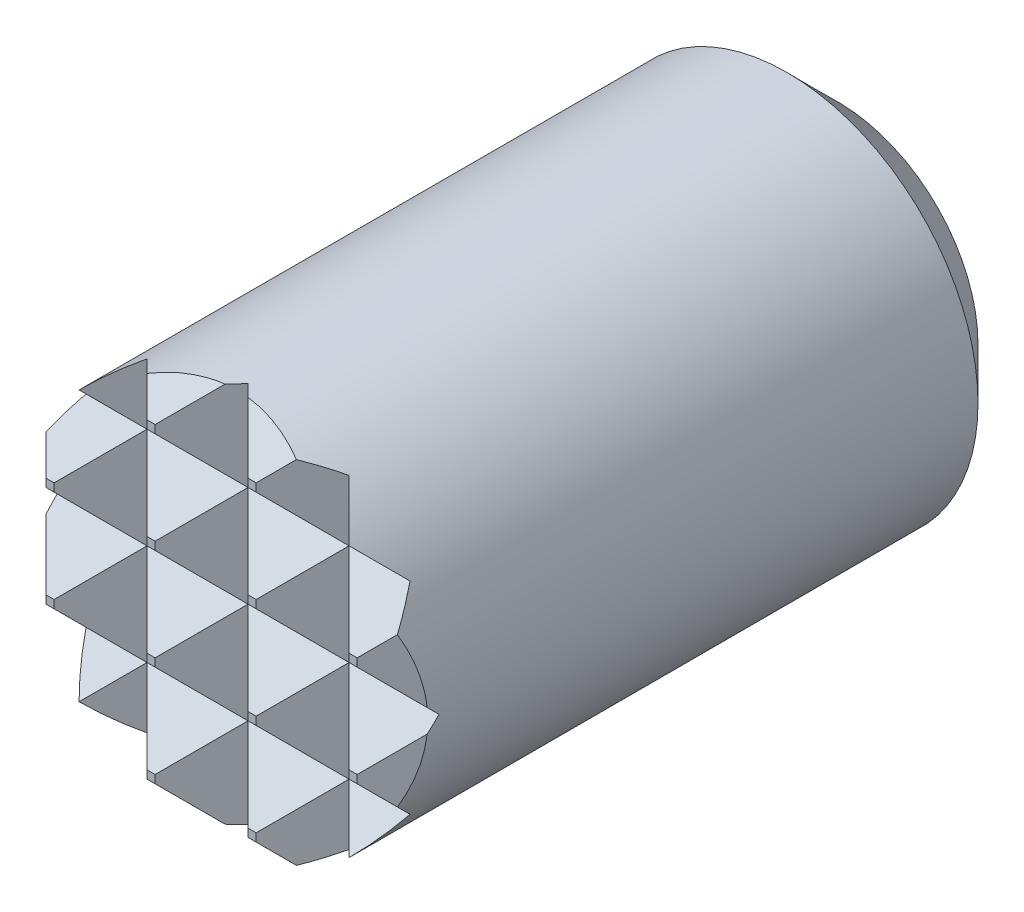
ISO-10303-21;
HEADER;
FILE_DESCRIPTION(('STEP AP214'),'2;1');
FILE_NAME('part.step','',(''),(''),'','','');
FILE_SCHEMA(('AUTOMOTIVE_DESIGN { 1 0 10303 214 1 1 1 1 }'));
ENDSEC;
DATA;
#1=APPLICATION_CONTEXT('core data for automotive mechanical design processes');
#2=APPLICATION_PROTOCOL_DEFINITION('international standard','automotive_design',2000,#1);
#3=PRODUCT_CONTEXT('',#1,'mechanical');
#4=PRODUCT('Part','Part','',(#3));
#5=PRODUCT_RELATED_PRODUCT_CATEGORY('part','',(#4));
#6=PRODUCT_DEFINITION_FORMATION('','',#4);
#7=PRODUCT_DEFINITION_CONTEXT('part definition',#1,'design');
#8=PRODUCT_DEFINITION('design','',#6,#7);
#9=PRODUCT_DEFINITION_SHAPE('','',#8);
#10=(LENGTH_UNIT() NAMED_UNIT(*) SI_UNIT(.MILLI.,.METRE.));
#11=(NAMED_UNIT(*) PLANE_ANGLE_UNIT() SI_UNIT($,.RADIAN.));
#12=(NAMED_UNIT(*) SI_UNIT($,.STERADIAN.) SOLID_ANGLE_UNIT());
#13=UNCERTAINTY_MEASURE_WITH_UNIT(LENGTH_MEASURE(1.E-05),#10,'distance_accuracy_value','');
#14=(GEOMETRIC_REPRESENTATION_CONTEXT(3) GLOBAL_UNCERTAINTY_ASSIGNED_CONTEXT((#13)) GLOBAL_UNIT_ASSIGNED_CONTEXT((#10,
#11,#12)) REPRESENTATION_CONTEXT('',''));
#15=CARTESIAN_POINT('',(0.,0.,0.));
#16=DIRECTION('',(0.,0.,1.));
#17=DIRECTION('',(1.,0.,0.));
#18=AXIS2_PLACEMENT_3D('',#15,#16,#17);
#19=CARTESIAN_POINT('',(0.,0.,10.));
#20=DIRECTION('',(0.,0.,1.));
#21=DIRECTION('',(1.,0.,0.));
#22=AXIS2_PLACEMENT_3D('',#19,#20,#21);
#23=PLANE('',#22);
#24=DIRECTION('',(0.,1.,0.));
#25=VECTOR('',#24,1.);
#26=CARTESIAN_POINT('',(-0.857250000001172,0.,10.));
#27=LINE('',#26,#25);
#28=CARTESIAN_POINT('',(-0.857250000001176,-0.857250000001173,10.));
#29=VERTEX_POINT('',#28);
#30=CARTESIAN_POINT('',(-0.857250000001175,-0.730249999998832,10.));
#31=VERTEX_POINT('',#30);
#32=EDGE_CURVE('E792',#29,#31,#27,.T.);
#33=ORIENTED_EDGE('',*,*,#32,.F.);
#34=DIRECTION('',(-1.,0.,0.));
#35=VECTOR('',#34,1.);
#36=CARTESIAN_POINT('',(0.,-0.857250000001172,10.));
#37=LINE('',#36,#35);
#38=CARTESIAN_POINT('',(-0.730249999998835,-0.857250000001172,10.));
#39=VERTEX_POINT('',#38);
#40=EDGE_CURVE('E317',#39,#29,#37,.T.);
#41=ORIENTED_EDGE('',*,*,#40,.F.);
#42=DIRECTION('',(0.,-1.,0.));
#43=VECTOR('',#42,1.);
#44=CARTESIAN_POINT('',(-0.730249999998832,0.,10.));
#45=LINE('',#44,#43);
#46=CARTESIAN_POINT('',(-0.730249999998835,-0.730249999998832,10.));
#47=VERTEX_POINT('',#46);
#48=EDGE_CURVE('E597',#47,#39,#45,.T.);
#49=ORIENTED_EDGE('',*,*,#48,.F.);
#50=DIRECTION('',(1.,0.,0.));
#51=VECTOR('',#50,1.);
#52=CARTESIAN_POINT('',(0.,-0.730249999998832,10.));
#53=LINE('',#52,#51);
#54=EDGE_CURVE('E514',#31,#47,#53,.T.);
#55=ORIENTED_EDGE('',*,*,#54,.F.);
#56=EDGE_LOOP('',(#33,#41,#49,#55));
#57=FACE_BOUND('',#56,.T.);
#58=ADVANCED_FACE('F15',(#57),#23,.T.);
#59=DIRECTION('',(0.,1.,0.));
#60=VECTOR('',#59,1.);
#61=CARTESIAN_POINT('',(-0.857250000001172,0.,10.));
#62=LINE('',#61,#60);
#63=CARTESIAN_POINT('',(-0.857250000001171,0.730249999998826,10.));
#64=VERTEX_POINT('',#63);
#65=CARTESIAN_POINT('',(-0.857250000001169,0.857250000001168,10.));
#66=VERTEX_POINT('',#65);
#67=EDGE_CURVE('E542',#64,#66,#62,.T.);
#68=ORIENTED_EDGE('',*,*,#67,.F.);
#69=DIRECTION('',(-1.,0.,0.));
#70=VECTOR('',#69,1.);
#71=CARTESIAN_POINT('',(0.,0.730249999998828,10.));
#72=LINE('',#71,#70);
#73=CARTESIAN_POINT('',(-0.73024999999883,0.730249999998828,10.));
#74=VERTEX_POINT('',#73);
#75=EDGE_CURVE('E521',#74,#64,#72,.T.);
#76=ORIENTED_EDGE('',*,*,#75,.F.);
#77=DIRECTION('',(0.,-1.,0.));
#78=VECTOR('',#77,1.);
#79=CARTESIAN_POINT('',(-0.730249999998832,0.,10.));
#80=LINE('',#79,#78);
#81=CARTESIAN_POINT('',(-0.730249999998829,0.857250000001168,10.));
#82=VERTEX_POINT('',#81);
#83=EDGE_CURVE('E541',#82,#74,#80,.T.);
#84=ORIENTED_EDGE('',*,*,#83,.F.);
#85=DIRECTION('',(1.,0.,0.));
#86=VECTOR('',#85,1.);
#87=CARTESIAN_POINT('',(0.,0.857250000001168,10.));
#88=LINE('',#87,#86);
#89=EDGE_CURVE('E507',#66,#82,#88,.T.);
#90=ORIENTED_EDGE('',*,*,#89,.F.);
#91=EDGE_LOOP('',(#68,#76,#84,#90));
#92=FACE_BOUND('',#91,.T.);
#93=ADVANCED_FACE('F539',(#92),#23,.T.);
#94=CARTESIAN_POINT('',(-3.,1.5875,9.26975000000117));
#95=DIRECTION('',(0.,0.707106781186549,-0.707106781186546));
#96=DIRECTION('',(0.,0.707106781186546,0.707106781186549));
#97=AXIS2_PLACEMENT_3D('',#94,#95,#96);
#98=PLANE('',#97);
#99=DIRECTION('',(-1.,0.,0.));
#100=VECTOR('',#99,1.);
#101=CARTESIAN_POINT('',(0.,2.31774999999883,10.));
#102=LINE('',#101,#100);
#103=CARTESIAN_POINT('',(-0.730249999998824,2.31774999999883,10.));
#104=VERTEX_POINT('',#103);
#105=CARTESIAN_POINT('',(-0.857250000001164,2.31774999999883,10.));
#106=VERTEX_POINT('',#105);
#107=EDGE_CURVE('E506',#104,#106,#102,.T.);
#108=ORIENTED_EDGE('',*,*,#107,.T.);
#109=DIRECTION('',(-0.577350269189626,-0.577350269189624,-0.577350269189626));
#110=VECTOR('',#109,1.);
#111=CARTESIAN_POINT('',(-2.05833333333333,1.11666666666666,8.79891666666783));
#112=LINE('',#111,#110);
#113=CARTESIAN_POINT('',(-1.5875,1.5875,9.26975000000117));
#114=VERTEX_POINT('',#113);
#115=EDGE_CURVE('E548',#106,#114,#112,.T.);
#116=ORIENTED_EDGE('',*,*,#115,.T.);
#117=DIRECTION('',(1.,0.,0.));
#118=VECTOR('',#117,1.);
#119=CARTESIAN_POINT('',(-3.,1.5875,9.26975000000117));
#120=LINE('',#119,#118);
#121=CARTESIAN_POINT('',(0.,1.5875,9.26975000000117));
#122=VERTEX_POINT('',#121);
#123=EDGE_CURVE('E484',#114,#122,#120,.T.);
#124=ORIENTED_EDGE('',*,*,#123,.T.);
#125=DIRECTION('',(-0.577350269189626,0.577350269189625,0.577350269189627));
#126=VECTOR('',#125,1.);
#127=CARTESIAN_POINT('',(-1.,2.5875,10.2697500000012));
#128=LINE('',#127,#126);
#129=EDGE_CURVE('E607',#122,#104,#128,.T.);
#130=ORIENTED_EDGE('',*,*,#129,.T.);
#131=EDGE_LOOP('',(#108,#116,#124,#130));
#132=FACE_BOUND('',#131,.T.);
#133=ADVANCED_FACE('F835',(#132),#98,.F.);
#134=CARTESIAN_POINT('',(-3.,0.79375,10.0635000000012));
#135=DIRECTION('',(0.,-0.707106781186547,-0.707106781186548));
#136=DIRECTION('',(0.,0.707106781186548,-0.707106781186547));
#137=AXIS2_PLACEMENT_3D('',#134,#135,#136);
#138=PLANE('',#137);
#139=ORIENTED_EDGE('',*,*,#123,.F.);
#140=DIRECTION('',(0.577350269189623,-0.577350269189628,0.577350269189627));
#141=VECTOR('',#140,1.);
#142=CARTESIAN_POINT('',(-1.52916666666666,1.52916666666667,9.3280833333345));
#143=LINE('',#142,#141);
#144=EDGE_CURVE('E546',#114,#66,#143,.T.);
#145=ORIENTED_EDGE('',*,*,#144,.T.);
#146=ORIENTED_EDGE('',*,*,#89,.T.);
#147=DIRECTION('',(0.577350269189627,0.577350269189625,-0.577350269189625));
#148=VECTOR('',#147,1.);
#149=CARTESIAN_POINT('',(-1.52916666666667,0.058333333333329,10.7989166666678));
#150=LINE('',#149,#148);
#151=EDGE_CURVE('E604',#82,#122,#150,.T.);
#152=ORIENTED_EDGE('',*,*,#151,.T.);
#153=EDGE_LOOP('',(#139,#145,#146,#152));
#154=FACE_BOUND('',#153,.T.);
#155=ADVANCED_FACE('F976',(#154),#138,.F.);
#156=CARTESIAN_POINT('',(-3.,0.,9.26975000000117));
#157=DIRECTION('',(0.,0.707106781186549,-0.707106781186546));
#158=DIRECTION('',(0.,0.707106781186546,0.707106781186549));
#159=AXIS2_PLACEMENT_3D('',#156,#157,#158);
#160=PLANE('',#159);
#161=ORIENTED_EDGE('',*,*,#75,.T.);
#162=DIRECTION('',(-0.577350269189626,-0.577350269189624,-0.577350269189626));
#163=VECTOR('',#162,1.);
#164=CARTESIAN_POINT('',(-2.05833333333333,-0.470833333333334,8.79891666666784));
#165=LINE('',#164,#163);
#166=CARTESIAN_POINT('',(-1.5875,0.,9.26975000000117));
#167=VERTEX_POINT('',#166);
#168=EDGE_CURVE('E532',#64,#167,#165,.T.);
#169=ORIENTED_EDGE('',*,*,#168,.T.);
#170=DIRECTION('',(1.,0.,0.));
#171=VECTOR('',#170,1.);
#172=CARTESIAN_POINT('',(-3.,0.,9.26975000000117));
#173=LINE('',#172,#171);
#174=CARTESIAN_POINT('',(0.,0.,9.26975000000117));
#175=VERTEX_POINT('',#174);
#176=EDGE_CURVE('E472',#167,#175,#173,.T.);
#177=ORIENTED_EDGE('',*,*,#176,.T.);
#178=DIRECTION('',(-0.577350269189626,0.577350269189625,0.577350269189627));
#179=VECTOR('',#178,1.);
#180=CARTESIAN_POINT('',(-1.,1.,10.2697500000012));
#181=LINE('',#180,#179);
#182=EDGE_CURVE('E535',#175,#74,#181,.T.);
#183=ORIENTED_EDGE('',*,*,#182,.T.);
#184=EDGE_LOOP('',(#161,#169,#177,#183));
#185=FACE_BOUND('',#184,.T.);
#186=ADVANCED_FACE('F531',(#185),#160,.F.);
#187=CARTESIAN_POINT('',(-3.,-0.79375,10.0635000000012));
#188=DIRECTION('',(0.,-0.707106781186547,-0.707106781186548));
#189=DIRECTION('',(0.,0.707106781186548,-0.707106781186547));
#190=AXIS2_PLACEMENT_3D('',#187,#188,#189);
#191=PLANE('',#190);
#192=ORIENTED_EDGE('',*,*,#176,.F.);
#193=DIRECTION('',(0.577350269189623,-0.577350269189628,0.577350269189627));
#194=VECTOR('',#193,1.);
#195=CARTESIAN_POINT('',(-1.52916666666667,-0.0583333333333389,9.32808333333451));
#196=LINE('',#195,#194);
#197=EDGE_CURVE('E550',#167,#31,#196,.T.);
#198=ORIENTED_EDGE('',*,*,#197,.T.);
#199=ORIENTED_EDGE('',*,*,#54,.T.);
#200=DIRECTION('',(0.577350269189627,0.577350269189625,-0.577350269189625));
#201=VECTOR('',#200,1.);
#202=CARTESIAN_POINT('',(-1.52916666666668,-1.52916666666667,10.7989166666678));
#203=LINE('',#202,#201);
#204=EDGE_CURVE('E599',#47,#175,#203,.T.);
#205=ORIENTED_EDGE('',*,*,#204,.T.);
#206=EDGE_LOOP('',(#192,#198,#199,#205));
#207=FACE_BOUND('',#206,.T.);
#208=ADVANCED_FACE('F700',(#207),#191,.F.);
#209=CARTESIAN_POINT('',(-3.,-1.5875,9.26975000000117));
#210=DIRECTION('',(0.,0.707106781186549,-0.707106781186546));
#211=DIRECTION('',(0.,0.707106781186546,0.707106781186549));
#212=AXIS2_PLACEMENT_3D('',#209,#210,#211);
#213=PLANE('',#212);
#214=ORIENTED_EDGE('',*,*,#40,.T.);
#215=DIRECTION('',(-0.577350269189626,-0.577350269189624,-0.577350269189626));
#216=VECTOR('',#215,1.);
#217=CARTESIAN_POINT('',(-2.05833333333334,-2.05833333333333,8.79891666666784));
#218=LINE('',#217,#216);
#219=CARTESIAN_POINT('',(-1.5875,-1.5875,9.26975000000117));
#220=VERTEX_POINT('',#219);
#221=EDGE_CURVE('E789',#29,#220,#218,.T.);
#222=ORIENTED_EDGE('',*,*,#221,.T.);
#223=DIRECTION('',(1.,0.,0.));
#224=VECTOR('',#223,1.);
#225=CARTESIAN_POINT('',(-3.,-1.5875,9.26975000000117));
#226=LINE('',#225,#224);
#227=CARTESIAN_POINT('',(0.,-1.5875,9.26975000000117));
#228=VERTEX_POINT('',#227);
#229=EDGE_CURVE('E461',#220,#228,#226,.T.);
#230=ORIENTED_EDGE('',*,*,#229,.T.);
#231=DIRECTION('',(-0.577350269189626,0.577350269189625,0.577350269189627));
#232=VECTOR('',#231,1.);
#233=CARTESIAN_POINT('',(-1.,-0.5875,10.2697500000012));
#234=LINE('',#233,#232);
#235=EDGE_CURVE('E594',#228,#39,#234,.T.);
#236=ORIENTED_EDGE('',*,*,#235,.T.);
#237=EDGE_LOOP('',(#214,#222,#230,#236));
#238=FACE_BOUND('',#237,.T.);
#239=ADVANCED_FACE('F798',(#238),#213,.F.);
#240=CARTESIAN_POINT('',(-3.,-2.38125,10.0635000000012));
#241=DIRECTION('',(0.,-0.707106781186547,-0.707106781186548));
#242=DIRECTION('',(0.,0.707106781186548,-0.707106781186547));
#243=AXIS2_PLACEMENT_3D('',#240,#241,#242);
#244=PLANE('',#243);
#245=ORIENTED_EDGE('',*,*,#229,.F.);
#246=DIRECTION('',(0.577350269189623,-0.577350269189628,0.577350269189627));
#247=VECTOR('',#246,1.);
#248=CARTESIAN_POINT('',(-1.52916666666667,-1.64583333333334,9.32808333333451));
#249=LINE('',#248,#247);
#250=CARTESIAN_POINT('',(-0.85725000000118,-2.31774999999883,10.));
#251=VERTEX_POINT('',#250);
#252=EDGE_CURVE('E786',#220,#251,#249,.T.);
#253=ORIENTED_EDGE('',*,*,#252,.T.);
#254=DIRECTION('',(1.,0.,0.));
#255=VECTOR('',#254,1.);
#256=CARTESIAN_POINT('',(0.,-2.31774999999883,10.));
#257=LINE('',#256,#255);
#258=CARTESIAN_POINT('',(-0.730249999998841,-2.31774999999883,10.));
#259=VERTEX_POINT('',#258);
#260=EDGE_CURVE('E318',#251,#259,#257,.T.);
#261=ORIENTED_EDGE('',*,*,#260,.T.);
#262=DIRECTION('',(0.577350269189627,0.577350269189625,-0.577350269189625));
#263=VECTOR('',#262,1.);
#264=CARTESIAN_POINT('',(-1.52916666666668,-3.11666666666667,10.7989166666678));
#265=LINE('',#264,#263);
#266=EDGE_CURVE('E591',#259,#228,#265,.T.);
#267=ORIENTED_EDGE('',*,*,#266,.T.);
#268=EDGE_LOOP('',(#245,#253,#261,#267));
#269=FACE_BOUND('',#268,.T.);
#270=ADVANCED_FACE('F801',(#269),#244,.F.);
#271=DIRECTION('',(0.,1.,0.));
#272=VECTOR('',#271,1.);
#273=CARTESIAN_POINT('',(0.730249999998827,0.,10.));
#274=LINE('',#273,#272);
#275=CARTESIAN_POINT('',(0.730249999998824,-0.857250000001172,10.));
#276=VERTEX_POINT('',#275);
#277=CARTESIAN_POINT('',(0.730249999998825,-0.730249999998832,10.));
#278=VERTEX_POINT('',#277);
#279=EDGE_CURVE('E350',#276,#278,#274,.T.);
#280=ORIENTED_EDGE('',*,*,#279,.F.);
#281=CARTESIAN_POINT('',(0.857250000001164,-0.857250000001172,10.));
#282=VERTEX_POINT('',#281);
#283=EDGE_CURVE('E322',#282,#276,#37,.T.);
#284=ORIENTED_EDGE('',*,*,#283,.F.);
#285=DIRECTION('',(0.,-1.,0.));
#286=VECTOR('',#285,1.);
#287=CARTESIAN_POINT('',(0.857250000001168,0.,10.));
#288=LINE('',#287,#286);
#289=CARTESIAN_POINT('',(0.857250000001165,-0.730249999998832,10.));
#290=VERTEX_POINT('',#289);
#291=EDGE_CURVE('E349',#290,#282,#288,.T.);
#292=ORIENTED_EDGE('',*,*,#291,.F.);
#293=EDGE_CURVE('E351',#278,#290,#53,.T.);
#294=ORIENTED_EDGE('',*,*,#293,.F.);
#295=EDGE_LOOP('',(#280,#284,#292,#294));
#296=FACE_BOUND('',#295,.T.);
#297=ADVANCED_FACE('F347',(#296),#23,.T.);
#298=DIRECTION('',(0.,1.,0.));
#299=VECTOR('',#298,1.);
#300=CARTESIAN_POINT('',(0.730249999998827,0.,10.));
#301=LINE('',#300,#299);
#302=CARTESIAN_POINT('',(0.73024999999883,0.730249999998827,10.));
#303=VERTEX_POINT('',#302);
#304=CARTESIAN_POINT('',(0.730249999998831,0.857250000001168,10.));
#305=VERTEX_POINT('',#304);
#306=EDGE_CURVE('E365',#303,#305,#301,.T.);
#307=ORIENTED_EDGE('',*,*,#306,.F.);
#308=CARTESIAN_POINT('',(0.85725000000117,0.730249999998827,10.));
#309=VERTEX_POINT('',#308);
#310=EDGE_CURVE('E517',#309,#303,#72,.T.);
#311=ORIENTED_EDGE('',*,*,#310,.F.);
#312=DIRECTION('',(0.,-1.,0.));
#313=VECTOR('',#312,1.);
#314=CARTESIAN_POINT('',(0.857250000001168,0.,10.));
#315=LINE('',#314,#313);
#316=CARTESIAN_POINT('',(0.857250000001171,0.857250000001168,10.));
#317=VERTEX_POINT('',#316);
#318=EDGE_CURVE('E401',#317,#309,#315,.T.);
#319=ORIENTED_EDGE('',*,*,#318,.F.);
#320=EDGE_CURVE('E914',#305,#317,#88,.T.);
#321=ORIENTED_EDGE('',*,*,#320,.F.);
#322=EDGE_LOOP('',(#307,#311,#319,#321));
#323=FACE_BOUND('',#322,.T.);
#324=ADVANCED_FACE('F950',(#323),#23,.T.);
#325=DIRECTION('',(0.,1.,0.));
#326=VECTOR('',#325,1.);
#327=CARTESIAN_POINT('',(0.730249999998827,0.,10.));
#328=LINE('',#327,#326);
#329=CARTESIAN_POINT('',(0.730249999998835,2.31774999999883,10.));
#330=VERTEX_POINT('',#329);
#331=CARTESIAN_POINT('',(0.730249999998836,2.44475000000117,10.));
#332=VERTEX_POINT('',#331);
#333=EDGE_CURVE('E373',#330,#332,#328,.T.);
#334=ORIENTED_EDGE('',*,*,#333,.F.);
#335=CARTESIAN_POINT('',(0.857250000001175,2.31774999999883,10.));
#336=VERTEX_POINT('',#335);
#337=EDGE_CURVE('E508',#336,#330,#102,.T.);
#338=ORIENTED_EDGE('',*,*,#337,.F.);
#339=DIRECTION('',(0.,-1.,0.));
#340=VECTOR('',#339,1.);
#341=CARTESIAN_POINT('',(0.857250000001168,0.,10.));
#342=LINE('',#341,#340);
#343=CARTESIAN_POINT('',(0.857250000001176,2.44475000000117,10.));
#344=VERTEX_POINT('',#343);
#345=EDGE_CURVE('E409',#344,#336,#342,.T.);
#346=ORIENTED_EDGE('',*,*,#345,.F.);
#347=DIRECTION('',(1.,0.,0.));
#348=VECTOR('',#347,1.);
#349=CARTESIAN_POINT('',(0.,2.44475000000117,10.));
#350=LINE('',#349,#348);
#351=EDGE_CURVE('E500',#332,#344,#350,.T.);
#352=ORIENTED_EDGE('',*,*,#351,.F.);
#353=EDGE_LOOP('',(#334,#338,#346,#352));
#354=FACE_BOUND('',#353,.T.);
#355=ADVANCED_FACE('F1398',(#354),#23,.T.);
#356=DIRECTION('',(0.,1.,0.));
#357=VECTOR('',#356,1.);
#358=CARTESIAN_POINT('',(0.730249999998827,0.,10.));
#359=LINE('',#358,#357);
#360=CARTESIAN_POINT('',(0.730249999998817,-2.44475000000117,10.));
#361=VERTEX_POINT('',#360);
#362=CARTESIAN_POINT('',(0.730249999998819,-2.31774999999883,10.));
#363=VERTEX_POINT('',#362);
#364=EDGE_CURVE('E615',#361,#363,#359,.T.);
#365=ORIENTED_EDGE('',*,*,#364,.F.);
#366=DIRECTION('',(-1.,0.,0.));
#367=VECTOR('',#366,1.);
#368=CARTESIAN_POINT('',(0.,-2.44475000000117,10.));
#369=LINE('',#368,#367);
#370=CARTESIAN_POINT('',(0.857250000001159,-2.44475000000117,10.));
#371=VERTEX_POINT('',#370);
#372=EDGE_CURVE('E333',#371,#361,#369,.T.);
#373=ORIENTED_EDGE('',*,*,#372,.F.);
#374=DIRECTION('',(0.,-1.,0.));
#375=VECTOR('',#374,1.);
#376=CARTESIAN_POINT('',(0.857250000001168,0.,10.));
#377=LINE('',#376,#375);
#378=CARTESIAN_POINT('',(0.857250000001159,-2.31774999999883,10.));
#379=VERTEX_POINT('',#378);
#380=EDGE_CURVE('E384',#379,#371,#377,.T.);
#381=ORIENTED_EDGE('',*,*,#380,.F.);
#382=EDGE_CURVE('E323',#363,#379,#257,.T.);
#383=ORIENTED_EDGE('',*,*,#382,.F.);
#384=EDGE_LOOP('',(#365,#373,#381,#383));
#385=FACE_BOUND('',#384,.T.);
#386=ADVANCED_FACE('F633',(#385),#23,.T.);
#387=CARTESIAN_POINT('',(-3.,2.38125,10.0635000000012));
#388=DIRECTION('',(0.,-0.707106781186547,-0.707106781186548));
#389=DIRECTION('',(0.,0.707106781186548,-0.707106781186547));
#390=AXIS2_PLACEMENT_3D('',#387,#388,#389);
#391=PLANE('',#390);
#392=CARTESIAN_POINT('',(0.,0.,12.4447500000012));
#393=DIRECTION('',(0.,-0.707106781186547,-0.707106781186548));
#394=DIRECTION('',(0.,0.707106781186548,-0.707106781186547));
#395=AXIS2_PLACEMENT_3D('',#392,#393,#394);
#396=ELLIPSE('',#395,4.24264068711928,3.);
#397=CARTESIAN_POINT('',(0.180430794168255,2.99456920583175,9.45018079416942));
#398=VERTEX_POINT('',#397);
#399=CARTESIAN_POINT('',(1.17347162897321,2.76097162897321,9.68377837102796));
#400=VERTEX_POINT('',#399);
#401=EDGE_CURVE('E494',#398,#400,#396,.T.);
#402=ORIENTED_EDGE('',*,*,#401,.F.);
#403=DIRECTION('',(0.577350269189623,-0.577350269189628,0.577350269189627));
#404=VECTOR('',#403,1.);
#405=CARTESIAN_POINT('',(-0.470833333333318,3.64583333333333,8.79891666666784));
#406=LINE('',#405,#404);
#407=EDGE_CURVE('E375',#398,#332,#406,.T.);
#408=ORIENTED_EDGE('',*,*,#407,.T.);
#409=ORIENTED_EDGE('',*,*,#351,.T.);
#410=DIRECTION('',(0.577350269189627,0.577350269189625,-0.577350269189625));
#411=VECTOR('',#410,1.);
#412=CARTESIAN_POINT('',(-0.470833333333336,1.11666666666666,11.3280833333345));
#413=LINE('',#412,#411);
#414=EDGE_CURVE('E411',#344,#400,#413,.T.);
#415=ORIENTED_EDGE('',*,*,#414,.T.);
#416=EDGE_LOOP('',(#402,#408,#409,#415));
#417=FACE_BOUND('',#416,.T.);
#418=ADVANCED_FACE('F1073',(#417),#391,.F.);
#419=ORIENTED_EDGE('',*,*,#337,.T.);
#420=DIRECTION('',(-0.577350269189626,-0.577350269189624,-0.577350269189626));
#421=VECTOR('',#420,1.);
#422=CARTESIAN_POINT('',(-1.,0.5875,8.26975000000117));
#423=LINE('',#422,#421);
#424=EDGE_CURVE('E370',#330,#122,#423,.T.);
#425=ORIENTED_EDGE('',*,*,#424,.T.);
#426=CARTESIAN_POINT('',(1.5875,1.5875,9.26975000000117));
#427=VERTEX_POINT('',#426);
#428=EDGE_CURVE('E875',#122,#427,#120,.T.);
#429=ORIENTED_EDGE('',*,*,#428,.T.);
#430=DIRECTION('',(-0.577350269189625,0.577350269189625,0.577350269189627));
#431=VECTOR('',#430,1.);
#432=CARTESIAN_POINT('',(0.0583333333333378,3.11666666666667,10.7989166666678));
#433=LINE('',#432,#431);
#434=EDGE_CURVE('E406',#427,#336,#433,.T.);
#435=ORIENTED_EDGE('',*,*,#434,.T.);
#436=EDGE_LOOP('',(#419,#425,#429,#435));
#437=FACE_BOUND('',#436,.T.);
#438=ADVANCED_FACE('F882',(#437),#98,.F.);
#439=ORIENTED_EDGE('',*,*,#428,.F.);
#440=DIRECTION('',(0.577350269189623,-0.577350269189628,0.577350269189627));
#441=VECTOR('',#440,1.);
#442=CARTESIAN_POINT('',(-0.470833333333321,2.05833333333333,8.79891666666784));
#443=LINE('',#442,#441);
#444=EDGE_CURVE('E367',#122,#305,#443,.T.);
#445=ORIENTED_EDGE('',*,*,#444,.T.);
#446=ORIENTED_EDGE('',*,*,#320,.T.);
#447=DIRECTION('',(0.577350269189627,0.577350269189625,-0.577350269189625));
#448=VECTOR('',#447,1.);
#449=CARTESIAN_POINT('',(-0.47083333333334,-0.470833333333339,11.3280833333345));
#450=LINE('',#449,#448);
#451=EDGE_CURVE('E403',#317,#427,#450,.T.);
#452=ORIENTED_EDGE('',*,*,#451,.T.);
#453=EDGE_LOOP('',(#439,#445,#446,#452));
#454=FACE_BOUND('',#453,.T.);
#455=ADVANCED_FACE('F912',(#454),#138,.F.);
#456=ORIENTED_EDGE('',*,*,#310,.T.);
#457=DIRECTION('',(-0.577350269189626,-0.577350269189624,-0.577350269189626));
#458=VECTOR('',#457,1.);
#459=CARTESIAN_POINT('',(-1.,-1.,8.26975000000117));
#460=LINE('',#459,#458);
#461=EDGE_CURVE('E357',#303,#175,#460,.T.);
#462=ORIENTED_EDGE('',*,*,#461,.T.);
#463=CARTESIAN_POINT('',(1.5875,0.,9.26975000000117));
#464=VERTEX_POINT('',#463);
#465=EDGE_CURVE('E667',#175,#464,#173,.T.);
#466=ORIENTED_EDGE('',*,*,#465,.T.);
#467=DIRECTION('',(-0.577350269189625,0.577350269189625,0.577350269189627));
#468=VECTOR('',#467,1.);
#469=CARTESIAN_POINT('',(0.0583333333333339,1.52916666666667,10.7989166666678));
#470=LINE('',#469,#468);
#471=EDGE_CURVE('E398',#464,#309,#470,.T.);
#472=ORIENTED_EDGE('',*,*,#471,.T.);
#473=EDGE_LOOP('',(#456,#462,#466,#472));
#474=FACE_BOUND('',#473,.T.);
#475=ADVANCED_FACE('F698',(#474),#160,.F.);
#476=ORIENTED_EDGE('',*,*,#465,.F.);
#477=DIRECTION('',(0.577350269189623,-0.577350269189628,0.577350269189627));
#478=VECTOR('',#477,1.);
#479=CARTESIAN_POINT('',(-0.470833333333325,0.470833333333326,8.79891666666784));
#480=LINE('',#479,#478);
#481=EDGE_CURVE('E355',#175,#278,#480,.T.);
#482=ORIENTED_EDGE('',*,*,#481,.T.);
#483=ORIENTED_EDGE('',*,*,#293,.T.);
#484=DIRECTION('',(0.577350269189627,0.577350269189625,-0.577350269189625));
#485=VECTOR('',#484,1.);
#486=CARTESIAN_POINT('',(-0.470833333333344,-2.05833333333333,11.3280833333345));
#487=LINE('',#486,#485);
#488=EDGE_CURVE('E395',#290,#464,#487,.T.);
#489=ORIENTED_EDGE('',*,*,#488,.T.);
#490=EDGE_LOOP('',(#476,#482,#483,#489));
#491=FACE_BOUND('',#490,.T.);
#492=ADVANCED_FACE('F696',(#491),#191,.F.);
#493=ORIENTED_EDGE('',*,*,#283,.T.);
#494=DIRECTION('',(-0.577350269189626,-0.577350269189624,-0.577350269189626));
#495=VECTOR('',#494,1.);
#496=CARTESIAN_POINT('',(-1.,-2.5875,8.26975000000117));
#497=LINE('',#496,#495);
#498=EDGE_CURVE('E340',#276,#228,#497,.T.);
#499=ORIENTED_EDGE('',*,*,#498,.T.);
#500=CARTESIAN_POINT('',(1.5875,-1.5875,9.26975000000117));
#501=VERTEX_POINT('',#500);
#502=EDGE_CURVE('E626',#228,#501,#226,.T.);
#503=ORIENTED_EDGE('',*,*,#502,.T.);
#504=DIRECTION('',(-0.577350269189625,0.577350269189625,0.577350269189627));
#505=VECTOR('',#504,1.);
#506=CARTESIAN_POINT('',(0.0583333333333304,-0.0583333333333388,10.7989166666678));
#507=LINE('',#506,#505);
#508=EDGE_CURVE('E343',#501,#282,#507,.T.);
#509=ORIENTED_EDGE('',*,*,#508,.T.);
#510=EDGE_LOOP('',(#493,#499,#503,#509));
#511=FACE_BOUND('',#510,.T.);
#512=ADVANCED_FACE('F339',(#511),#213,.F.);
#513=ORIENTED_EDGE('',*,*,#502,.F.);
#514=DIRECTION('',(0.577350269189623,-0.577350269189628,0.577350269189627));
#515=VECTOR('',#514,1.);
#516=CARTESIAN_POINT('',(-0.470833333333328,-1.11666666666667,8.79891666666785));
#517=LINE('',#516,#515);
#518=EDGE_CURVE('E359',#228,#363,#517,.T.);
#519=ORIENTED_EDGE('',*,*,#518,.T.);
#520=ORIENTED_EDGE('',*,*,#382,.T.);
#521=DIRECTION('',(0.577350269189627,0.577350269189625,-0.577350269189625));
#522=VECTOR('',#521,1.);
#523=CARTESIAN_POINT('',(-0.470833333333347,-3.64583333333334,11.3280833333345));
#524=LINE('',#523,#522);
#525=EDGE_CURVE('E389',#379,#501,#524,.T.);
#526=ORIENTED_EDGE('',*,*,#525,.T.);
#527=EDGE_LOOP('',(#513,#519,#520,#526));
#528=FACE_BOUND('',#527,.T.);
#529=ADVANCED_FACE('F624',(#528),#244,.F.);
#530=CARTESIAN_POINT('',(-3.,-3.175,9.26975000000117));
#531=DIRECTION('',(0.,0.707106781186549,-0.707106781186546));
#532=DIRECTION('',(0.,0.707106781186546,0.707106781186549));
#533=AXIS2_PLACEMENT_3D('',#530,#531,#532);
#534=PLANE('',#533);
#535=ORIENTED_EDGE('',*,*,#372,.T.);
#536=DIRECTION('',(-0.577350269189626,-0.577350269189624,-0.577350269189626));
#537=VECTOR('',#536,1.);
#538=CARTESIAN_POINT('',(-1.,-4.175,8.26975000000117));
#539=LINE('',#538,#537);
#540=CARTESIAN_POINT('',(0.180430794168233,-2.99456920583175,9.45018079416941));
#541=VERTEX_POINT('',#540);
#542=EDGE_CURVE('E655',#361,#541,#539,.T.);
#543=ORIENTED_EDGE('',*,*,#542,.T.);
#544=CARTESIAN_POINT('',(0.,0.,12.4447500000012));
#545=DIRECTION('',(0.,0.707106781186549,-0.707106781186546));
#546=DIRECTION('',(0.,-0.707106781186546,-0.707106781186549));
#547=AXIS2_PLACEMENT_3D('',#544,#545,#546);
#548=ELLIPSE('',#547,4.24264068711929,3.);
#549=CARTESIAN_POINT('',(1.1734716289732,-2.76097162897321,9.68377837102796));
#550=VERTEX_POINT('',#549);
#551=EDGE_CURVE('E454',#550,#541,#548,.T.);
#552=ORIENTED_EDGE('',*,*,#551,.F.);
#553=DIRECTION('',(-0.577350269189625,0.577350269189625,0.577350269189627));
#554=VECTOR('',#553,1.);
#555=CARTESIAN_POINT('',(0.0583333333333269,-1.64583333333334,10.7989166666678));
#556=LINE('',#555,#554);
#557=EDGE_CURVE('E639',#550,#371,#556,.T.);
#558=ORIENTED_EDGE('',*,*,#557,.T.);
#559=EDGE_LOOP('',(#535,#543,#552,#558));
#560=FACE_BOUND('',#559,.T.);
#561=ADVANCED_FACE('F643',(#560),#534,.F.);
#562=DIRECTION('',(0.,1.,0.));
#563=VECTOR('',#562,1.);
#564=CARTESIAN_POINT('',(2.31774999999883,0.,10.));
#565=LINE('',#564,#563);
#566=CARTESIAN_POINT('',(2.31774999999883,-0.857250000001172,10.));
#567=VERTEX_POINT('',#566);
#568=CARTESIAN_POINT('',(2.31774999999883,-0.730249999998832,10.));
#569=VERTEX_POINT('',#568);
#570=EDGE_CURVE('E419',#567,#569,#565,.T.);
#571=ORIENTED_EDGE('',*,*,#570,.F.);
#572=CARTESIAN_POINT('',(2.44475000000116,-0.857250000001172,10.));
#573=VERTEX_POINT('',#572);
#574=EDGE_CURVE('E320',#573,#567,#37,.T.);
#575=ORIENTED_EDGE('',*,*,#574,.F.);
#576=DIRECTION('',(0.,-1.,0.));
#577=VECTOR('',#576,1.);
#578=CARTESIAN_POINT('',(2.44475000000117,0.,10.));
#579=LINE('',#578,#577);
#580=CARTESIAN_POINT('',(2.44475000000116,-0.730249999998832,10.));
#581=VERTEX_POINT('',#580);
#582=EDGE_CURVE('E439',#581,#573,#579,.T.);
#583=ORIENTED_EDGE('',*,*,#582,.F.);
#584=EDGE_CURVE('E511',#569,#581,#53,.T.);
#585=ORIENTED_EDGE('',*,*,#584,.F.);
#586=EDGE_LOOP('',(#571,#575,#583,#585));
#587=FACE_BOUND('',#586,.T.);
#588=ADVANCED_FACE('F717',(#587),#23,.T.);
#589=DIRECTION('',(0.,1.,0.));
#590=VECTOR('',#589,1.);
#591=CARTESIAN_POINT('',(2.31774999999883,0.,10.));
#592=LINE('',#591,#590);
#593=CARTESIAN_POINT('',(2.31774999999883,0.730249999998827,10.));
#594=VERTEX_POINT('',#593);
#595=CARTESIAN_POINT('',(2.31774999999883,0.857250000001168,10.));
#596=VERTEX_POINT('',#595);
#597=EDGE_CURVE('E428',#594,#596,#592,.T.);
#598=ORIENTED_EDGE('',*,*,#597,.F.);
#599=CARTESIAN_POINT('',(2.44475000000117,0.730249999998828,10.));
#600=VERTEX_POINT('',#599);
#601=EDGE_CURVE('E515',#600,#594,#72,.T.);
#602=ORIENTED_EDGE('',*,*,#601,.F.);
#603=DIRECTION('',(0.,-1.,0.));
#604=VECTOR('',#603,1.);
#605=CARTESIAN_POINT('',(2.44475000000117,0.,10.));
#606=LINE('',#605,#604);
#607=CARTESIAN_POINT('',(2.44475000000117,0.857250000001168,10.));
#608=VERTEX_POINT('',#607);
#609=EDGE_CURVE('E448',#608,#600,#606,.T.);
#610=ORIENTED_EDGE('',*,*,#609,.F.);
#611=EDGE_CURVE('E503',#596,#608,#88,.T.);
#612=ORIENTED_EDGE('',*,*,#611,.F.);
#613=EDGE_LOOP('',(#598,#602,#610,#612));
#614=FACE_BOUND('',#613,.T.);
#615=ADVANCED_FACE('F922',(#614),#23,.T.);
#616=CARTESIAN_POINT('',(0.,0.,7.68225000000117));
#617=DIRECTION('',(0.,0.707106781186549,-0.707106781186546));
#618=DIRECTION('',(0.,-0.707106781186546,-0.707106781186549));
#619=AXIS2_PLACEMENT_3D('',#616,#617,#618);
#620=ELLIPSE('',#619,4.24264068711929,3.);
#621=CARTESIAN_POINT('',(2.12132034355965,2.12132034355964,9.80357034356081));
#622=VERTEX_POINT('',#621);
#623=CARTESIAN_POINT('',(2.54555372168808,1.5875,9.26975000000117));
#624=VERTEX_POINT('',#623);
#625=EDGE_CURVE('E488',#622,#624,#620,.T.);
#626=ORIENTED_EDGE('',*,*,#625,.F.);
#627=DIRECTION('',(-0.577350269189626,-0.577350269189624,-0.577350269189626));
#628=VECTOR('',#627,1.);
#629=CARTESIAN_POINT('',(0.0583333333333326,0.0583333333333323,7.7405833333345));
#630=LINE('',#629,#628);
#631=EDGE_CURVE('E433',#622,#427,#630,.T.);
#632=ORIENTED_EDGE('',*,*,#631,.T.);
#633=EDGE_CURVE('E485',#427,#624,#120,.T.);
#634=ORIENTED_EDGE('',*,*,#633,.T.);
#635=EDGE_LOOP('',(#626,#632,#634));
#636=FACE_BOUND('',#635,.T.);
#637=ADVANCED_FACE('F911',(#636),#98,.F.);
#638=ORIENTED_EDGE('',*,*,#633,.F.);
#639=DIRECTION('',(0.577350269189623,-0.577350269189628,0.577350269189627));
#640=VECTOR('',#639,1.);
#641=CARTESIAN_POINT('',(0.587500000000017,2.5875,8.26975000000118));
#642=LINE('',#641,#640);
#643=EDGE_CURVE('E430',#427,#596,#642,.T.);
#644=ORIENTED_EDGE('',*,*,#643,.T.);
#645=ORIENTED_EDGE('',*,*,#611,.T.);
#646=DIRECTION('',(0.577350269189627,0.577350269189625,-0.577350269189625));
#647=VECTOR('',#646,1.);
#648=CARTESIAN_POINT('',(0.587499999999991,-1.,11.8572500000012));
#649=LINE('',#648,#647);
#650=CARTESIAN_POINT('',(2.76097162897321,1.1734716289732,9.68377837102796));
#651=VERTEX_POINT('',#650);
#652=EDGE_CURVE('E450',#608,#651,#649,.T.);
#653=ORIENTED_EDGE('',*,*,#652,.T.);
#654=CARTESIAN_POINT('',(0.,0.,10.8572500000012));
#655=DIRECTION('',(0.,-0.707106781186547,-0.707106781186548));
#656=DIRECTION('',(0.,0.707106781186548,-0.707106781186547));
#657=AXIS2_PLACEMENT_3D('',#654,#655,#656);
#658=ELLIPSE('',#657,4.24264068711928,3.);
#659=EDGE_CURVE('E487',#624,#651,#658,.T.);
#660=ORIENTED_EDGE('',*,*,#659,.F.);
#661=EDGE_LOOP('',(#638,#644,#645,#653,#660));
#662=FACE_BOUND('',#661,.T.);
#663=ADVANCED_FACE('F909',(#662),#138,.F.);
#664=ORIENTED_EDGE('',*,*,#601,.T.);
#665=DIRECTION('',(-0.577350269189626,-0.577350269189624,-0.577350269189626));
#666=VECTOR('',#665,1.);
#667=CARTESIAN_POINT('',(0.0583333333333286,-1.52916666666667,7.7405833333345));
#668=LINE('',#667,#666);
#669=EDGE_CURVE('E425',#594,#464,#668,.T.);
#670=ORIENTED_EDGE('',*,*,#669,.T.);
#671=CARTESIAN_POINT('',(3.,0.,9.26975000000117));
#672=VERTEX_POINT('',#671);
#673=EDGE_CURVE('E473',#464,#672,#173,.T.);
#674=ORIENTED_EDGE('',*,*,#673,.T.);
#675=CARTESIAN_POINT('',(0.,0.,9.26975000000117));
#676=DIRECTION('',(0.,0.707106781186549,-0.707106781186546));
#677=DIRECTION('',(0.,-0.707106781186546,-0.707106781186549));
#678=AXIS2_PLACEMENT_3D('',#675,#676,#677);
#679=ELLIPSE('',#678,4.24264068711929,3.);
#680=CARTESIAN_POINT('',(2.99456920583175,0.180430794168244,9.45018079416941));
#681=VERTEX_POINT('',#680);
#682=EDGE_CURVE('E476',#681,#672,#679,.T.);
#683=ORIENTED_EDGE('',*,*,#682,.F.);
#684=DIRECTION('',(-0.577350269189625,0.577350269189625,0.577350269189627));
#685=VECTOR('',#684,1.);
#686=CARTESIAN_POINT('',(1.11666666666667,2.05833333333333,11.3280833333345));
#687=LINE('',#686,#685);
#688=EDGE_CURVE('E445',#681,#600,#687,.T.);
#689=ORIENTED_EDGE('',*,*,#688,.T.);
#690=EDGE_LOOP('',(#664,#670,#674,#683,#689));
#691=FACE_BOUND('',#690,.T.);
#692=ADVANCED_FACE('F963',(#691),#160,.F.);
#693=ORIENTED_EDGE('',*,*,#673,.F.);
#694=DIRECTION('',(0.577350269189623,-0.577350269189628,0.577350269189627));
#695=VECTOR('',#694,1.);
#696=CARTESIAN_POINT('',(0.587500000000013,1.,8.26975000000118));
#697=LINE('',#696,#695);
#698=EDGE_CURVE('E422',#464,#569,#697,.T.);
#699=ORIENTED_EDGE('',*,*,#698,.T.);
#700=ORIENTED_EDGE('',*,*,#584,.T.);
#701=DIRECTION('',(0.577350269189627,0.577350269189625,-0.577350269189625));
#702=VECTOR('',#701,1.);
#703=CARTESIAN_POINT('',(0.587499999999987,-2.5875,11.8572500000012));
#704=LINE('',#703,#702);
#705=CARTESIAN_POINT('',(2.99456920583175,-0.180430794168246,9.45018079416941));
#706=VERTEX_POINT('',#705);
#707=EDGE_CURVE('E442',#581,#706,#704,.T.);
#708=ORIENTED_EDGE('',*,*,#707,.T.);
#709=CARTESIAN_POINT('',(0.,0.,9.26975000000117));
#710=DIRECTION('',(0.,-0.707106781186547,-0.707106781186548));
#711=DIRECTION('',(0.,0.707106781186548,-0.707106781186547));
#712=AXIS2_PLACEMENT_3D('',#709,#710,#711);
#713=ELLIPSE('',#712,4.24264068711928,3.);
#714=EDGE_CURVE('E475',#672,#706,#713,.T.);
#715=ORIENTED_EDGE('',*,*,#714,.F.);
#716=EDGE_LOOP('',(#693,#699,#700,#708,#715));
#717=FACE_BOUND('',#716,.T.);
#718=ADVANCED_FACE('F708',(#717),#191,.F.);
#719=ORIENTED_EDGE('',*,*,#574,.T.);
#720=DIRECTION('',(-0.577350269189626,-0.577350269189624,-0.577350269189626));
#721=VECTOR('',#720,1.);
#722=CARTESIAN_POINT('',(0.0583333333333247,-3.11666666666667,7.7405833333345));
#723=LINE('',#722,#721);
#724=EDGE_CURVE('E414',#567,#501,#723,.T.);
#725=ORIENTED_EDGE('',*,*,#724,.T.);
#726=CARTESIAN_POINT('',(2.54555372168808,-1.5875,9.26975000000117));
#727=VERTEX_POINT('',#726);
#728=EDGE_CURVE('E457',#501,#727,#226,.T.);
#729=ORIENTED_EDGE('',*,*,#728,.T.);
#730=CARTESIAN_POINT('',(0.,0.,10.8572500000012));
#731=DIRECTION('',(0.,0.707106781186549,-0.707106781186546));
#732=DIRECTION('',(0.,-0.707106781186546,-0.707106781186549));
#733=AXIS2_PLACEMENT_3D('',#730,#731,#732);
#734=ELLIPSE('',#733,4.24264068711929,3.);
#735=CARTESIAN_POINT('',(2.76097162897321,-1.17347162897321,9.68377837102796));
#736=VERTEX_POINT('',#735);
#737=EDGE_CURVE('E464',#736,#727,#734,.T.);
#738=ORIENTED_EDGE('',*,*,#737,.F.);
#739=DIRECTION('',(-0.577350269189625,0.577350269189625,0.577350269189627));
#740=VECTOR('',#739,1.);
#741=CARTESIAN_POINT('',(1.11666666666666,0.470833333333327,11.3280833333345));
#742=LINE('',#741,#740);
#743=EDGE_CURVE('E646',#736,#573,#742,.T.);
#744=ORIENTED_EDGE('',*,*,#743,.T.);
#745=EDGE_LOOP('',(#719,#725,#729,#738,#744));
#746=FACE_BOUND('',#745,.T.);
#747=ADVANCED_FACE('F722',(#746),#213,.F.);
#748=ORIENTED_EDGE('',*,*,#728,.F.);
#749=DIRECTION('',(0.577350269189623,-0.577350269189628,0.577350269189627));
#750=VECTOR('',#749,1.);
#751=CARTESIAN_POINT('',(0.58750000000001,-0.587500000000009,8.26975000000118));
#752=LINE('',#751,#750);
#753=CARTESIAN_POINT('',(2.12132034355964,-2.12132034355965,9.80357034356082));
#754=VERTEX_POINT('',#753);
#755=EDGE_CURVE('E645',#501,#754,#752,.T.);
#756=ORIENTED_EDGE('',*,*,#755,.T.);
#757=CARTESIAN_POINT('',(0.,0.,7.68225000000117));
#758=DIRECTION('',(0.,-0.707106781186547,-0.707106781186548));
#759=DIRECTION('',(0.,0.707106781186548,-0.707106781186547));
#760=AXIS2_PLACEMENT_3D('',#757,#758,#759);
#761=ELLIPSE('',#760,4.24264068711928,3.);
#762=EDGE_CURVE('E463',#727,#754,#761,.T.);
#763=ORIENTED_EDGE('',*,*,#762,.F.);
#764=EDGE_LOOP('',(#748,#756,#763));
#765=FACE_BOUND('',#764,.T.);
#766=ADVANCED_FACE('F730',(#765),#244,.F.);
#767=DIRECTION('',(0.,1.,0.));
#768=VECTOR('',#767,1.);
#769=CARTESIAN_POINT('',(-2.44475000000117,0.,10.));
#770=LINE('',#769,#768);
#771=CARTESIAN_POINT('',(-2.44475000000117,-0.857250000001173,10.));
#772=VERTEX_POINT('',#771);
#773=CARTESIAN_POINT('',(-2.44475000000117,-0.730249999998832,10.));
#774=VERTEX_POINT('',#773);
#775=EDGE_CURVE('E297',#772,#774,#770,.T.);
#776=ORIENTED_EDGE('',*,*,#775,.F.);
#777=CARTESIAN_POINT('',(-2.31774999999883,-0.857250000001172,10.));
#778=VERTEX_POINT('',#777);
#779=EDGE_CURVE('E308',#778,#772,#37,.T.);
#780=ORIENTED_EDGE('',*,*,#779,.F.);
#781=DIRECTION('',(0.,-1.,0.));
#782=VECTOR('',#781,1.);
#783=CARTESIAN_POINT('',(-2.31774999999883,0.,10.));
#784=LINE('',#783,#782);
#785=CARTESIAN_POINT('',(-2.31774999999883,-0.730249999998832,10.));
#786=VERTEX_POINT('',#785);
#787=EDGE_CURVE('E566',#786,#778,#784,.T.);
#788=ORIENTED_EDGE('',*,*,#787,.F.);
#789=EDGE_CURVE('E309',#774,#786,#53,.T.);
#790=ORIENTED_EDGE('',*,*,#789,.F.);
#791=EDGE_LOOP('',(#776,#780,#788,#790));
#792=FACE_BOUND('',#791,.T.);
#793=ADVANCED_FACE('F306',(#792),#23,.T.);
#794=DIRECTION('',(0.,1.,0.));
#795=VECTOR('',#794,1.);
#796=CARTESIAN_POINT('',(-2.44475000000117,0.,10.));
#797=LINE('',#796,#795);
#798=CARTESIAN_POINT('',(-2.44475000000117,0.730249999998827,10.));
#799=VERTEX_POINT('',#798);
#800=CARTESIAN_POINT('',(-2.44475000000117,0.857250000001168,10.));
#801=VERTEX_POINT('',#800);
#802=EDGE_CURVE('E768',#799,#801,#797,.T.);
#803=ORIENTED_EDGE('',*,*,#802,.F.);
#804=CARTESIAN_POINT('',(-2.31774999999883,0.730249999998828,10.));
#805=VERTEX_POINT('',#804);
#806=EDGE_CURVE('E513',#805,#799,#72,.T.);
#807=ORIENTED_EDGE('',*,*,#806,.F.);
#808=DIRECTION('',(0.,-1.,0.));
#809=VECTOR('',#808,1.);
#810=CARTESIAN_POINT('',(-2.31774999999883,0.,10.));
#811=LINE('',#810,#809);
#812=CARTESIAN_POINT('',(-2.31774999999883,0.857250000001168,10.));
#813=VERTEX_POINT('',#812);
#814=EDGE_CURVE('E573',#813,#805,#811,.T.);
#815=ORIENTED_EDGE('',*,*,#814,.F.);
#816=EDGE_CURVE('E504',#801,#813,#88,.T.);
#817=ORIENTED_EDGE('',*,*,#816,.F.);
#818=EDGE_LOOP('',(#803,#807,#815,#817));
#819=FACE_BOUND('',#818,.T.);
#820=ADVANCED_FACE('F767',(#819),#23,.T.);
#821=DIRECTION('',(0.,1.,0.));
#822=VECTOR('',#821,1.);
#823=CARTESIAN_POINT('',(-0.857250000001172,0.,10.));
#824=LINE('',#823,#822);
#825=CARTESIAN_POINT('',(-0.857250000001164,2.44475000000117,10.));
#826=VERTEX_POINT('',#825);
#827=EDGE_CURVE('E556',#106,#826,#824,.T.);
#828=ORIENTED_EDGE('',*,*,#827,.F.);
#829=ORIENTED_EDGE('',*,*,#107,.F.);
#830=DIRECTION('',(0.,-1.,0.));
#831=VECTOR('',#830,1.);
#832=CARTESIAN_POINT('',(-0.730249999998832,0.,10.));
#833=LINE('',#832,#831);
#834=CARTESIAN_POINT('',(-0.730249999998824,2.44475000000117,10.));
#835=VERTEX_POINT('',#834);
#836=EDGE_CURVE('E610',#835,#104,#833,.T.);
#837=ORIENTED_EDGE('',*,*,#836,.F.);
#838=EDGE_CURVE('E501',#826,#835,#350,.T.);
#839=ORIENTED_EDGE('',*,*,#838,.F.);
#840=EDGE_LOOP('',(#828,#829,#837,#839));
#841=FACE_BOUND('',#840,.T.);
#842=ADVANCED_FACE('F840',(#841),#23,.T.);
#843=CARTESIAN_POINT('',(0.,0.,10.));
#844=DIRECTION('',(0.,0.,-1.));
#845=DIRECTION('',(-1.,0.,0.));
#846=AXIS2_PLACEMENT_3D('',#843,#844,#845);
#847=CYLINDRICAL_SURFACE('',#846,3.);
#848=CARTESIAN_POINT('',(0.,0.,0.800000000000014));
#849=DIRECTION('',(0.,0.,1.));
#850=DIRECTION('',(1.,0.,0.));
#851=AXIS2_PLACEMENT_3D('',#848,#849,#850);
#852=CIRCLE('',#851,3.);
#853=CARTESIAN_POINT('',(3.,0.,0.800000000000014));
#854=VERTEX_POINT('',#853);
#855=EDGE_CURVE('E493',#854,#854,#852,.T.);
#856=ORIENTED_EDGE('',*,*,#855,.T.);
#857=EDGE_LOOP('',(#856));
#858=FACE_BOUND('',#857,.T.);
#859=CARTESIAN_POINT('',(-3.,0.,9.26975000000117));
#860=VERTEX_POINT('',#859);
#861=CARTESIAN_POINT('',(-2.99456920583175,0.180430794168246,9.45018079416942));
#862=VERTEX_POINT('',#861);
#863=EDGE_CURVE('E479',#860,#862,#679,.T.);
#864=ORIENTED_EDGE('',*,*,#863,.T.);
#865=CARTESIAN_POINT('',(0.,0.,12.4447500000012));
#866=DIRECTION('',(0.707106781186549,0.,-0.707106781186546));
#867=DIRECTION('',(-0.707106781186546,0.,-0.707106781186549));
#868=AXIS2_PLACEMENT_3D('',#865,#866,#867);
#869=ELLIPSE('',#868,4.24264068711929,3.);
#870=CARTESIAN_POINT('',(-2.76097162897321,1.17347162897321,9.68377837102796));
#871=VERTEX_POINT('',#870);
#872=EDGE_CURVE('E30',#862,#871,#869,.T.);
#873=ORIENTED_EDGE('',*,*,#872,.T.);
#874=CARTESIAN_POINT('',(-2.54555372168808,1.5875,9.26975000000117));
#875=VERTEX_POINT('',#874);
#876=EDGE_CURVE('E483',#871,#875,#658,.T.);
#877=ORIENTED_EDGE('',*,*,#876,.T.);
#878=CARTESIAN_POINT('',(-2.12132034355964,2.12132034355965,9.80357034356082));
#879=VERTEX_POINT('',#878);
#880=EDGE_CURVE('E490',#875,#879,#620,.T.);
#881=ORIENTED_EDGE('',*,*,#880,.T.);
#882=CARTESIAN_POINT('',(0.,0.,7.68225000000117));
#883=DIRECTION('',(-0.707106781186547,0.,-0.707106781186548));
#884=DIRECTION('',(0.707106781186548,0.,-0.707106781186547));
#885=AXIS2_PLACEMENT_3D('',#882,#883,#884);
#886=ELLIPSE('',#885,4.24264068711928,3.);
#887=CARTESIAN_POINT('',(-1.5875,2.54555372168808,9.26975000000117));
#888=VERTEX_POINT('',#887);
#889=EDGE_CURVE('E567',#879,#888,#886,.T.);
#890=ORIENTED_EDGE('',*,*,#889,.T.);
#891=CARTESIAN_POINT('',(0.,0.,10.8572500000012));
#892=DIRECTION('',(0.707106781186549,0.,-0.707106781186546));
#893=DIRECTION('',(-0.707106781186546,0.,-0.707106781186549));
#894=AXIS2_PLACEMENT_3D('',#891,#892,#893);
#895=ELLIPSE('',#894,4.24264068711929,3.);
#896=CARTESIAN_POINT('',(-1.1734716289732,2.76097162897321,9.68377837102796));
#897=VERTEX_POINT('',#896);
#898=EDGE_CURVE('E561',#888,#897,#895,.T.);
#899=ORIENTED_EDGE('',*,*,#898,.T.);
#900=CARTESIAN_POINT('',(-0.180430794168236,2.99456920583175,9.45018079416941));
#901=VERTEX_POINT('',#900);
#902=EDGE_CURVE('E491',#897,#901,#396,.T.);
#903=ORIENTED_EDGE('',*,*,#902,.T.);
#904=CARTESIAN_POINT('',(0.,0.,9.26975000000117));
#905=DIRECTION('',(-0.707106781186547,0.,-0.707106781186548));
#906=DIRECTION('',(0.707106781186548,0.,-0.707106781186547));
#907=AXIS2_PLACEMENT_3D('',#904,#905,#906);
#908=ELLIPSE('',#907,4.24264068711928,3.);
#909=CARTESIAN_POINT('',(0.,3.,9.26975000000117));
#910=VERTEX_POINT('',#909);
#911=EDGE_CURVE('E592',#901,#910,#908,.T.);
#912=ORIENTED_EDGE('',*,*,#911,.T.);
#913=CARTESIAN_POINT('',(0.,0.,9.26975000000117));
#914=DIRECTION('',(0.707106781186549,0.,-0.707106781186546));
#915=DIRECTION('',(-0.707106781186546,0.,-0.707106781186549));
#916=AXIS2_PLACEMENT_3D('',#913,#914,#915);
#917=ELLIPSE('',#916,4.24264068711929,3.);
#918=EDGE_CURVE('E378',#910,#398,#917,.T.);
#919=ORIENTED_EDGE('',*,*,#918,.T.);
#920=ORIENTED_EDGE('',*,*,#401,.T.);
#921=CARTESIAN_POINT('',(0.,0.,10.8572500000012));
#922=DIRECTION('',(-0.707106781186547,0.,-0.707106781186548));
#923=DIRECTION('',(0.707106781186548,0.,-0.707106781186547));
#924=AXIS2_PLACEMENT_3D('',#921,#922,#923);
#925=ELLIPSE('',#924,4.24264068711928,3.);
#926=CARTESIAN_POINT('',(1.5875,2.54555372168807,9.26975000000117));
#927=VERTEX_POINT('',#926);
#928=EDGE_CURVE('E390',#400,#927,#925,.T.);
#929=ORIENTED_EDGE('',*,*,#928,.T.);
#930=CARTESIAN_POINT('',(0.,0.,7.68225000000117));
#931=DIRECTION('',(0.707106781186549,0.,-0.707106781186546));
#932=DIRECTION('',(-0.707106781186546,0.,-0.707106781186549));
#933=AXIS2_PLACEMENT_3D('',#930,#931,#932);
#934=ELLIPSE('',#933,4.24264068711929,3.);
#935=EDGE_CURVE('E420',#927,#622,#934,.T.);
#936=ORIENTED_EDGE('',*,*,#935,.T.);
#937=ORIENTED_EDGE('',*,*,#625,.T.);
#938=ORIENTED_EDGE('',*,*,#659,.T.);
#939=CARTESIAN_POINT('',(0.,0.,12.4447500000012));
#940=DIRECTION('',(-0.707106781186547,0.,-0.707106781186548));
#941=DIRECTION('',(0.707106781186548,0.,-0.707106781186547));
#942=AXIS2_PLACEMENT_3D('',#939,#940,#941);
#943=ELLIPSE('',#942,4.24264068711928,3.);
#944=EDGE_CURVE('E440',#651,#681,#943,.T.);
#945=ORIENTED_EDGE('',*,*,#944,.T.);
#946=ORIENTED_EDGE('',*,*,#682,.T.);
#947=ORIENTED_EDGE('',*,*,#714,.T.);
#948=EDGE_CURVE('E436',#706,#736,#943,.T.);
#949=ORIENTED_EDGE('',*,*,#948,.T.);
#950=ORIENTED_EDGE('',*,*,#737,.T.);
#951=ORIENTED_EDGE('',*,*,#762,.T.);
#952=CARTESIAN_POINT('',(1.5875,-2.54555372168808,9.26975000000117));
#953=VERTEX_POINT('',#952);
#954=EDGE_CURVE('E416',#754,#953,#934,.T.);
#955=ORIENTED_EDGE('',*,*,#954,.T.);
#956=EDGE_CURVE('E386',#953,#550,#925,.T.);
#957=ORIENTED_EDGE('',*,*,#956,.T.);
#958=ORIENTED_EDGE('',*,*,#551,.T.);
#959=CARTESIAN_POINT('',(0.,-3.,9.26975000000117));
#960=VERTEX_POINT('',#959);
#961=EDGE_CURVE('E617',#541,#960,#917,.T.);
#962=ORIENTED_EDGE('',*,*,#961,.T.);
#963=CARTESIAN_POINT('',(-0.180430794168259,-2.99456920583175,9.45018079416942));
#964=VERTEX_POINT('',#963);
#965=EDGE_CURVE('E588',#960,#964,#908,.T.);
#966=ORIENTED_EDGE('',*,*,#965,.T.);
#967=CARTESIAN_POINT('',(-1.17347162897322,-2.76097162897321,9.68377837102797));
#968=VERTEX_POINT('',#967);
#969=EDGE_CURVE('E453',#964,#968,#548,.T.);
#970=ORIENTED_EDGE('',*,*,#969,.T.);
#971=CARTESIAN_POINT('',(-1.5875,-2.54555372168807,9.26975000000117));
#972=VERTEX_POINT('',#971);
#973=EDGE_CURVE('E783',#968,#972,#895,.T.);
#974=ORIENTED_EDGE('',*,*,#973,.T.);
#975=CARTESIAN_POINT('',(-2.12132034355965,-2.12132034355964,9.80357034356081));
#976=VERTEX_POINT('',#975);
#977=EDGE_CURVE('E563',#972,#976,#886,.T.);
#978=ORIENTED_EDGE('',*,*,#977,.T.);
#979=CARTESIAN_POINT('',(-2.54555372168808,-1.5875,9.26975000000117));
#980=VERTEX_POINT('',#979);
#981=EDGE_CURVE('E460',#976,#980,#761,.T.);
#982=ORIENTED_EDGE('',*,*,#981,.T.);
#983=CARTESIAN_POINT('',(-2.76097162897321,-1.17347162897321,9.68377837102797));
#984=VERTEX_POINT('',#983);
#985=EDGE_CURVE('E467',#980,#984,#734,.T.);
#986=ORIENTED_EDGE('',*,*,#985,.T.);
#987=CARTESIAN_POINT('',(-2.99456920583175,-0.180430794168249,9.45018079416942));
#988=VERTEX_POINT('',#987);
#989=EDGE_CURVE('E38',#984,#988,#869,.T.);
#990=ORIENTED_EDGE('',*,*,#989,.T.);
#991=EDGE_CURVE('E471',#988,#860,#713,.T.);
#992=ORIENTED_EDGE('',*,*,#991,.T.);
#993=EDGE_LOOP('',(#864,#873,#877,#881,#890,#899,#903,#912,#919,#920,#929,#936,#937,#938,#945,
#946,#947,#949,#950,#951,#955,#957,#958,#962,#966,#970,#974,#978,#982,#986,#990,#992));
#994=FACE_BOUND('',#993,.T.);
#995=ADVANCED_FACE('F729',(#858,#994),#847,.T.);
#996=DIRECTION('',(0.,1.,0.));
#997=VECTOR('',#996,1.);
#998=CARTESIAN_POINT('',(-0.857250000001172,0.,10.));
#999=LINE('',#998,#997);
#1000=CARTESIAN_POINT('',(-0.857250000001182,-2.44475000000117,10.));
#1001=VERTEX_POINT('',#1000);
#1002=EDGE_CURVE('E781',#1001,#251,#999,.T.);
#1003=ORIENTED_EDGE('',*,*,#1002,.F.);
#1004=CARTESIAN_POINT('',(-0.73024999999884,-2.44475000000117,10.));
#1005=VERTEX_POINT('',#1004);
#1006=EDGE_CURVE('E327',#1005,#1001,#369,.T.);
#1007=ORIENTED_EDGE('',*,*,#1006,.F.);
#1008=DIRECTION('',(0.,-1.,0.));
#1009=VECTOR('',#1008,1.);
#1010=CARTESIAN_POINT('',(-0.730249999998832,0.,10.));
#1011=LINE('',#1010,#1009);
#1012=EDGE_CURVE('E584',#259,#1005,#1011,.T.);
#1013=ORIENTED_EDGE('',*,*,#1012,.F.);
#1014=ORIENTED_EDGE('',*,*,#260,.F.);
#1015=EDGE_LOOP('',(#1003,#1007,#1013,#1014));
#1016=FACE_BOUND('',#1015,.T.);
#1017=ADVANCED_FACE('F809',(#1016),#23,.T.);
#1018=CARTESIAN_POINT('',(0.,0.,0.));
#1019=DIRECTION('',(0.,0.,1.));
#1020=DIRECTION('',(1.,0.,0.));
#1021=AXIS2_PLACEMENT_3D('',#1018,#1019,#1020);
#1022=PLANE('',#1021);
#1023=CARTESIAN_POINT('',(0.,0.,0.));
#1024=DIRECTION('',(0.,0.,-1.));
#1025=DIRECTION('',(-1.,0.,0.));
#1026=AXIS2_PLACEMENT_3D('',#1023,#1024,#1025);
#1027=CIRCLE('',#1026,1.5);
#1028=CARTESIAN_POINT('',(-1.5,0.,0.));
#1029=VERTEX_POINT('',#1028);
#1030=EDGE_CURVE('E1340',#1029,#1029,#1027,.T.);
#1031=ORIENTED_EDGE('',*,*,#1030,.F.);
#1032=EDGE_LOOP('',(#1031));
#1033=FACE_BOUND('',#1032,.T.);
#1034=CARTESIAN_POINT('',(0.,0.,0.));
#1035=DIRECTION('',(0.,0.,1.));
#1036=DIRECTION('',(1.,0.,0.));
#1037=AXIS2_PLACEMENT_3D('',#1034,#1035,#1036);
#1038=CIRCLE('',#1037,2.2);
#1039=CARTESIAN_POINT('',(2.2,0.,0.));
#1040=VERTEX_POINT('',#1039);
#1041=EDGE_CURVE('E497',#1040,#1040,#1038,.F.);
#1042=ORIENTED_EDGE('',*,*,#1041,.T.);
#1043=EDGE_LOOP('',(#1042));
#1044=FACE_BOUND('',#1043,.T.);
#1045=ADVANCED_FACE('F839',(#1033,#1044),#1022,.F.);
#1046=CARTESIAN_POINT('',(0.,0.,0.800000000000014));
#1047=DIRECTION('',(0.,0.,1.));
#1048=DIRECTION('',(1.,0.,0.));
#1049=AXIS2_PLACEMENT_3D('',#1046,#1047,#1048);
#1050=CONICAL_SURFACE('',#1049,3.,0.785398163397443);
#1051=ORIENTED_EDGE('',*,*,#1041,.F.);
#1052=EDGE_LOOP('',(#1051));
#1053=FACE_BOUND('',#1052,.T.);
#1054=ORIENTED_EDGE('',*,*,#855,.F.);
#1055=EDGE_LOOP('',(#1054));
#1056=FACE_BOUND('',#1055,.T.);
#1057=ADVANCED_FACE('F17',(#1053,#1056),#1050,.T.);
#1058=ORIENTED_EDGE('',*,*,#902,.F.);
#1059=DIRECTION('',(0.577350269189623,-0.577350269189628,0.577350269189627));
#1060=VECTOR('',#1059,1.);
#1061=CARTESIAN_POINT('',(-1.52916666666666,3.11666666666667,9.3280833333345));
#1062=LINE('',#1061,#1060);
#1063=EDGE_CURVE('E558',#897,#826,#1062,.T.);
#1064=ORIENTED_EDGE('',*,*,#1063,.T.);
#1065=ORIENTED_EDGE('',*,*,#838,.T.);
#1066=DIRECTION('',(0.577350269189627,0.577350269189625,-0.577350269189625));
#1067=VECTOR('',#1066,1.);
#1068=CARTESIAN_POINT('',(-1.52916666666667,1.64583333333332,10.7989166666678));
#1069=LINE('',#1068,#1067);
#1070=EDGE_CURVE('E612',#835,#901,#1069,.T.);
#1071=ORIENTED_EDGE('',*,*,#1070,.T.);
#1072=EDGE_LOOP('',(#1058,#1064,#1065,#1071));
#1073=FACE_BOUND('',#1072,.T.);
#1074=ADVANCED_FACE('F866',(#1073),#391,.F.);
#1075=EDGE_CURVE('E480',#875,#114,#120,.T.);
#1076=ORIENTED_EDGE('',*,*,#1075,.T.);
#1077=DIRECTION('',(-0.577350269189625,0.577350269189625,0.577350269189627));
#1078=VECTOR('',#1077,1.);
#1079=CARTESIAN_POINT('',(-2.05833333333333,2.05833333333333,9.7405833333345));
#1080=LINE('',#1079,#1078);
#1081=EDGE_CURVE('E578',#114,#879,#1080,.T.);
#1082=ORIENTED_EDGE('',*,*,#1081,.T.);
#1083=ORIENTED_EDGE('',*,*,#880,.F.);
#1084=EDGE_LOOP('',(#1076,#1082,#1083));
#1085=FACE_BOUND('',#1084,.T.);
#1086=ADVANCED_FACE('F750',(#1085),#98,.F.);
#1087=ORIENTED_EDGE('',*,*,#876,.F.);
#1088=DIRECTION('',(0.577350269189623,-0.577350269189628,0.577350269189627));
#1089=VECTOR('',#1088,1.);
#1090=CARTESIAN_POINT('',(-2.5875,1.,9.85725000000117));
#1091=LINE('',#1090,#1089);
#1092=EDGE_CURVE('E769',#871,#801,#1091,.T.);
#1093=ORIENTED_EDGE('',*,*,#1092,.T.);
#1094=ORIENTED_EDGE('',*,*,#816,.T.);
#1095=DIRECTION('',(0.577350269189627,0.577350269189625,-0.577350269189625));
#1096=VECTOR('',#1095,1.);
#1097=CARTESIAN_POINT('',(-2.5875,0.5875,10.2697500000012));
#1098=LINE('',#1097,#1096);
#1099=EDGE_CURVE('E575',#813,#114,#1098,.T.);
#1100=ORIENTED_EDGE('',*,*,#1099,.T.);
#1101=ORIENTED_EDGE('',*,*,#1075,.F.);
#1102=EDGE_LOOP('',(#1087,#1093,#1094,#1100,#1101));
#1103=FACE_BOUND('',#1102,.T.);
#1104=ADVANCED_FACE('F754',(#1103),#138,.F.);
#1105=ORIENTED_EDGE('',*,*,#806,.T.);
#1106=DIRECTION('',(-0.577350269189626,-0.577350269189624,-0.577350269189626));
#1107=VECTOR('',#1106,1.);
#1108=CARTESIAN_POINT('',(-3.11666666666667,0.0583333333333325,9.3280833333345));
#1109=LINE('',#1108,#1107);
#1110=EDGE_CURVE('E773',#799,#862,#1109,.T.);
#1111=ORIENTED_EDGE('',*,*,#1110,.T.);
#1112=ORIENTED_EDGE('',*,*,#863,.F.);
#1113=EDGE_CURVE('E468',#860,#167,#173,.T.);
#1114=ORIENTED_EDGE('',*,*,#1113,.T.);
#1115=DIRECTION('',(-0.577350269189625,0.577350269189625,0.577350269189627));
#1116=VECTOR('',#1115,1.);
#1117=CARTESIAN_POINT('',(-2.05833333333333,0.470833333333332,9.7405833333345));
#1118=LINE('',#1117,#1116);
#1119=EDGE_CURVE('E571',#167,#805,#1118,.T.);
#1120=ORIENTED_EDGE('',*,*,#1119,.T.);
#1121=EDGE_LOOP('',(#1105,#1111,#1112,#1114,#1120));
#1122=FACE_BOUND('',#1121,.T.);
#1123=ADVANCED_FACE('F873',(#1122),#160,.F.);
#1124=ORIENTED_EDGE('',*,*,#991,.F.);
#1125=DIRECTION('',(0.577350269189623,-0.577350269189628,0.577350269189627));
#1126=VECTOR('',#1125,1.);
#1127=CARTESIAN_POINT('',(-2.5875,-0.5875,9.85725000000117));
#1128=LINE('',#1127,#1126);
#1129=EDGE_CURVE('E310',#988,#774,#1128,.T.);
#1130=ORIENTED_EDGE('',*,*,#1129,.T.);
#1131=ORIENTED_EDGE('',*,*,#789,.T.);
#1132=DIRECTION('',(0.577350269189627,0.577350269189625,-0.577350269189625));
#1133=VECTOR('',#1132,1.);
#1134=CARTESIAN_POINT('',(-2.5875,-1.,10.2697500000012));
#1135=LINE('',#1134,#1133);
#1136=EDGE_CURVE('E569',#786,#167,#1135,.T.);
#1137=ORIENTED_EDGE('',*,*,#1136,.T.);
#1138=ORIENTED_EDGE('',*,*,#1113,.F.);
#1139=EDGE_LOOP('',(#1124,#1130,#1131,#1137,#1138));
#1140=FACE_BOUND('',#1139,.T.);
#1141=ADVANCED_FACE('F871',(#1140),#191,.F.);
#1142=ORIENTED_EDGE('',*,*,#779,.T.);
#1143=DIRECTION('',(-0.577350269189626,-0.577350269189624,-0.577350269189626));
#1144=VECTOR('',#1143,1.);
#1145=CARTESIAN_POINT('',(-3.11666666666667,-1.52916666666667,9.3280833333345));
#1146=LINE('',#1145,#1144);
#1147=EDGE_CURVE('E9',#772,#984,#1146,.T.);
#1148=ORIENTED_EDGE('',*,*,#1147,.T.);
#1149=ORIENTED_EDGE('',*,*,#985,.F.);
#1150=EDGE_CURVE('E458',#980,#220,#226,.T.);
#1151=ORIENTED_EDGE('',*,*,#1150,.T.);
#1152=DIRECTION('',(-0.577350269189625,0.577350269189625,0.577350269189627));
#1153=VECTOR('',#1152,1.);
#1154=CARTESIAN_POINT('',(-2.05833333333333,-1.11666666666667,9.7405833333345));
#1155=LINE('',#1154,#1153);
#1156=EDGE_CURVE('E316',#220,#778,#1155,.T.);
#1157=ORIENTED_EDGE('',*,*,#1156,.T.);
#1158=EDGE_LOOP('',(#1142,#1148,#1149,#1151,#1157));
#1159=FACE_BOUND('',#1158,.T.);
#1160=ADVANCED_FACE('F313',(#1159),#213,.F.);
#1161=ORIENTED_EDGE('',*,*,#981,.F.);
#1162=DIRECTION('',(0.577350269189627,0.577350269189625,-0.577350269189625));
#1163=VECTOR('',#1162,1.);
#1164=CARTESIAN_POINT('',(-2.5875,-2.5875,10.2697500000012));
#1165=LINE('',#1164,#1163);
#1166=EDGE_CURVE('E23',#976,#220,#1165,.T.);
#1167=ORIENTED_EDGE('',*,*,#1166,.T.);
#1168=ORIENTED_EDGE('',*,*,#1150,.F.);
#1169=EDGE_LOOP('',(#1161,#1167,#1168));
#1170=FACE_BOUND('',#1169,.T.);
#1171=ADVANCED_FACE('F663',(#1170),#244,.F.);
#1172=ORIENTED_EDGE('',*,*,#1006,.T.);
#1173=DIRECTION('',(-0.577350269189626,-0.577350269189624,-0.577350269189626));
#1174=VECTOR('',#1173,1.);
#1175=CARTESIAN_POINT('',(-2.05833333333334,-3.64583333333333,8.79891666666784));
#1176=LINE('',#1175,#1174);
#1177=EDGE_CURVE('E657',#1001,#968,#1176,.T.);
#1178=ORIENTED_EDGE('',*,*,#1177,.T.);
#1179=ORIENTED_EDGE('',*,*,#969,.F.);
#1180=DIRECTION('',(-0.577350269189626,0.577350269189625,0.577350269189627));
#1181=VECTOR('',#1180,1.);
#1182=CARTESIAN_POINT('',(-1.,-2.175,10.2697500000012));
#1183=LINE('',#1182,#1181);
#1184=EDGE_CURVE('E649',#964,#1005,#1183,.T.);
#1185=ORIENTED_EDGE('',*,*,#1184,.T.);
#1186=EDGE_LOOP('',(#1172,#1178,#1179,#1185));
#1187=FACE_BOUND('',#1186,.T.);
#1188=ADVANCED_FACE('F811',(#1187),#534,.F.);
#1189=CARTESIAN_POINT('',(2.38125,3.,10.0635000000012));
#1190=DIRECTION('',(-0.707106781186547,0.,-0.707106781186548));
#1191=DIRECTION('',(-0.707106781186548,0.,0.707106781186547));
#1192=AXIS2_PLACEMENT_3D('',#1189,#1190,#1191);
#1193=PLANE('',#1192);
#1194=ORIENTED_EDGE('',*,*,#582,.T.);
#1195=ORIENTED_EDGE('',*,*,#743,.F.);
#1196=ORIENTED_EDGE('',*,*,#948,.F.);
#1197=ORIENTED_EDGE('',*,*,#707,.F.);
#1198=EDGE_LOOP('',(#1194,#1195,#1196,#1197));
#1199=FACE_BOUND('',#1198,.T.);
#1200=ADVANCED_FACE('F716',(#1199),#1193,.F.);
#1201=ORIENTED_EDGE('',*,*,#609,.T.);
#1202=ORIENTED_EDGE('',*,*,#688,.F.);
#1203=ORIENTED_EDGE('',*,*,#944,.F.);
#1204=ORIENTED_EDGE('',*,*,#652,.F.);
#1205=EDGE_LOOP('',(#1201,#1202,#1203,#1204));
#1206=FACE_BOUND('',#1205,.T.);
#1207=ADVANCED_FACE('F920',(#1206),#1193,.F.);
#1208=CARTESIAN_POINT('',(0.79375,3.,10.0635000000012));
#1209=DIRECTION('',(-0.707106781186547,0.,-0.707106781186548));
#1210=DIRECTION('',(-0.707106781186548,0.,0.707106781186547));
#1211=AXIS2_PLACEMENT_3D('',#1208,#1209,#1210);
#1212=PLANE('',#1211);
#1213=ORIENTED_EDGE('',*,*,#380,.T.);
#1214=ORIENTED_EDGE('',*,*,#557,.F.);
#1215=ORIENTED_EDGE('',*,*,#956,.F.);
#1216=DIRECTION('',(0.,-1.,0.));
#1217=VECTOR('',#1216,1.);
#1218=CARTESIAN_POINT('',(1.5875,3.,9.26975000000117));
#1219=LINE('',#1218,#1217);
#1220=EDGE_CURVE('E379',#501,#953,#1219,.T.);
#1221=ORIENTED_EDGE('',*,*,#1220,.F.);
#1222=ORIENTED_EDGE('',*,*,#525,.F.);
#1223=EDGE_LOOP('',(#1213,#1214,#1215,#1221,#1222));
#1224=FACE_BOUND('',#1223,.T.);
#1225=ADVANCED_FACE('F638',(#1224),#1212,.F.);
#1226=CARTESIAN_POINT('',(1.5875,3.,9.26975000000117));
#1227=DIRECTION('',(0.707106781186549,0.,-0.707106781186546));
#1228=DIRECTION('',(-0.707106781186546,0.,-0.707106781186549));
#1229=AXIS2_PLACEMENT_3D('',#1226,#1227,#1228);
#1230=PLANE('',#1229);
#1231=ORIENTED_EDGE('',*,*,#755,.F.);
#1232=ORIENTED_EDGE('',*,*,#1220,.T.);
#1233=ORIENTED_EDGE('',*,*,#954,.F.);
#1234=EDGE_LOOP('',(#1231,#1232,#1233));
#1235=FACE_BOUND('',#1234,.T.);
#1236=ADVANCED_FACE('F733',(#1235),#1230,.F.);
#1237=ORIENTED_EDGE('',*,*,#291,.T.);
#1238=ORIENTED_EDGE('',*,*,#508,.F.);
#1239=EDGE_CURVE('E382',#464,#501,#1219,.T.);
#1240=ORIENTED_EDGE('',*,*,#1239,.F.);
#1241=ORIENTED_EDGE('',*,*,#488,.F.);
#1242=EDGE_LOOP('',(#1237,#1238,#1240,#1241));
#1243=FACE_BOUND('',#1242,.T.);
#1244=ADVANCED_FACE('F1137',(#1243),#1212,.F.);
#1245=ORIENTED_EDGE('',*,*,#1239,.T.);
#1246=ORIENTED_EDGE('',*,*,#724,.F.);
#1247=ORIENTED_EDGE('',*,*,#570,.T.);
#1248=ORIENTED_EDGE('',*,*,#698,.F.);
#1249=EDGE_LOOP('',(#1245,#1246,#1247,#1248));
#1250=FACE_BOUND('',#1249,.T.);
#1251=ADVANCED_FACE('F720',(#1250),#1230,.F.);
#1252=ORIENTED_EDGE('',*,*,#318,.T.);
#1253=ORIENTED_EDGE('',*,*,#471,.F.);
#1254=EDGE_CURVE('E893',#427,#464,#1219,.T.);
#1255=ORIENTED_EDGE('',*,*,#1254,.F.);
#1256=ORIENTED_EDGE('',*,*,#451,.F.);
#1257=EDGE_LOOP('',(#1252,#1253,#1255,#1256));
#1258=FACE_BOUND('',#1257,.T.);
#1259=ADVANCED_FACE('F907',(#1258),#1212,.F.);
#1260=ORIENTED_EDGE('',*,*,#1254,.T.);
#1261=ORIENTED_EDGE('',*,*,#669,.F.);
#1262=ORIENTED_EDGE('',*,*,#597,.T.);
#1263=ORIENTED_EDGE('',*,*,#643,.F.);
#1264=EDGE_LOOP('',(#1260,#1261,#1262,#1263));
#1265=FACE_BOUND('',#1264,.T.);
#1266=ADVANCED_FACE('F900',(#1265),#1230,.F.);
#1267=EDGE_CURVE('E383',#927,#427,#1219,.T.);
#1268=ORIENTED_EDGE('',*,*,#1267,.T.);
#1269=ORIENTED_EDGE('',*,*,#631,.F.);
#1270=ORIENTED_EDGE('',*,*,#935,.F.);
#1271=EDGE_LOOP('',(#1268,#1269,#1270));
#1272=FACE_BOUND('',#1271,.T.);
#1273=ADVANCED_FACE('F888',(#1272),#1230,.F.);
#1274=ORIENTED_EDGE('',*,*,#414,.F.);
#1275=ORIENTED_EDGE('',*,*,#345,.T.);
#1276=ORIENTED_EDGE('',*,*,#434,.F.);
#1277=ORIENTED_EDGE('',*,*,#1267,.F.);
#1278=ORIENTED_EDGE('',*,*,#928,.F.);
#1279=EDGE_LOOP('',(#1274,#1275,#1276,#1277,#1278));
#1280=FACE_BOUND('',#1279,.T.);
#1281=ADVANCED_FACE('F896',(#1280),#1212,.F.);
#1282=CARTESIAN_POINT('',(-0.79375,3.,10.0635000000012));
#1283=DIRECTION('',(-0.707106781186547,0.,-0.707106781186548));
#1284=DIRECTION('',(-0.707106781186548,0.,0.707106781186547));
#1285=AXIS2_PLACEMENT_3D('',#1282,#1283,#1284);
#1286=PLANE('',#1285);
#1287=ORIENTED_EDGE('',*,*,#1012,.T.);
#1288=ORIENTED_EDGE('',*,*,#1184,.F.);
#1289=ORIENTED_EDGE('',*,*,#965,.F.);
#1290=DIRECTION('',(0.,-1.,0.));
#1291=VECTOR('',#1290,1.);
#1292=CARTESIAN_POINT('',(0.,3.,9.26975000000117));
#1293=LINE('',#1292,#1291);
#1294=EDGE_CURVE('E586',#228,#960,#1293,.T.);
#1295=ORIENTED_EDGE('',*,*,#1294,.F.);
#1296=ORIENTED_EDGE('',*,*,#266,.F.);
#1297=EDGE_LOOP('',(#1287,#1288,#1289,#1295,#1296));
#1298=FACE_BOUND('',#1297,.T.);
#1299=ADVANCED_FACE('F805',(#1298),#1286,.F.);
#1300=CARTESIAN_POINT('',(0.,3.,9.26975000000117));
#1301=DIRECTION('',(0.707106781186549,0.,-0.707106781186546));
#1302=DIRECTION('',(-0.707106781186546,0.,-0.707106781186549));
#1303=AXIS2_PLACEMENT_3D('',#1300,#1301,#1302);
#1304=PLANE('',#1303);
#1305=ORIENTED_EDGE('',*,*,#1294,.T.);
#1306=ORIENTED_EDGE('',*,*,#961,.F.);
#1307=ORIENTED_EDGE('',*,*,#542,.F.);
#1308=ORIENTED_EDGE('',*,*,#364,.T.);
#1309=ORIENTED_EDGE('',*,*,#518,.F.);
#1310=EDGE_LOOP('',(#1305,#1306,#1307,#1308,#1309));
#1311=FACE_BOUND('',#1310,.T.);
#1312=ADVANCED_FACE('F736',(#1311),#1304,.F.);
#1313=ORIENTED_EDGE('',*,*,#48,.T.);
#1314=ORIENTED_EDGE('',*,*,#235,.F.);
#1315=EDGE_CURVE('E685',#175,#228,#1293,.T.);
#1316=ORIENTED_EDGE('',*,*,#1315,.F.);
#1317=ORIENTED_EDGE('',*,*,#204,.F.);
#1318=EDGE_LOOP('',(#1313,#1314,#1316,#1317));
#1319=FACE_BOUND('',#1318,.T.);
#1320=ADVANCED_FACE('F694',(#1319),#1286,.F.);
#1321=ORIENTED_EDGE('',*,*,#1315,.T.);
#1322=ORIENTED_EDGE('',*,*,#498,.F.);
#1323=ORIENTED_EDGE('',*,*,#279,.T.);
#1324=ORIENTED_EDGE('',*,*,#481,.F.);
#1325=EDGE_LOOP('',(#1321,#1322,#1323,#1324));
#1326=FACE_BOUND('',#1325,.T.);
#1327=ADVANCED_FACE('F689',(#1326),#1304,.F.);
#1328=ORIENTED_EDGE('',*,*,#83,.T.);
#1329=ORIENTED_EDGE('',*,*,#182,.F.);
#1330=EDGE_CURVE('E585',#122,#175,#1293,.T.);
#1331=ORIENTED_EDGE('',*,*,#1330,.F.);
#1332=ORIENTED_EDGE('',*,*,#151,.F.);
#1333=EDGE_LOOP('',(#1328,#1329,#1331,#1332));
#1334=FACE_BOUND('',#1333,.T.);
#1335=ADVANCED_FACE('F686',(#1334),#1286,.F.);
#1336=ORIENTED_EDGE('',*,*,#1330,.T.);
#1337=ORIENTED_EDGE('',*,*,#461,.F.);
#1338=ORIENTED_EDGE('',*,*,#306,.T.);
#1339=ORIENTED_EDGE('',*,*,#444,.F.);
#1340=EDGE_LOOP('',(#1336,#1337,#1338,#1339));
#1341=FACE_BOUND('',#1340,.T.);
#1342=ADVANCED_FACE('F680',(#1341),#1304,.F.);
#1343=EDGE_CURVE('E581',#910,#122,#1293,.T.);
#1344=ORIENTED_EDGE('',*,*,#1343,.T.);
#1345=ORIENTED_EDGE('',*,*,#424,.F.);
#1346=ORIENTED_EDGE('',*,*,#333,.T.);
#1347=ORIENTED_EDGE('',*,*,#407,.F.);
#1348=ORIENTED_EDGE('',*,*,#918,.F.);
#1349=EDGE_LOOP('',(#1344,#1345,#1346,#1347,#1348));
#1350=FACE_BOUND('',#1349,.T.);
#1351=ADVANCED_FACE('F1207',(#1350),#1304,.F.);
#1352=ORIENTED_EDGE('',*,*,#1070,.F.);
#1353=ORIENTED_EDGE('',*,*,#836,.T.);
#1354=ORIENTED_EDGE('',*,*,#129,.F.);
#1355=ORIENTED_EDGE('',*,*,#1343,.F.);
#1356=ORIENTED_EDGE('',*,*,#911,.F.);
#1357=EDGE_LOOP('',(#1352,#1353,#1354,#1355,#1356));
#1358=FACE_BOUND('',#1357,.T.);
#1359=ADVANCED_FACE('F824',(#1358),#1286,.F.);
#1360=CARTESIAN_POINT('',(-1.5875,3.,9.26975000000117));
#1361=DIRECTION('',(0.707106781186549,0.,-0.707106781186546));
#1362=DIRECTION('',(-0.707106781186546,0.,-0.707106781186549));
#1363=AXIS2_PLACEMENT_3D('',#1360,#1361,#1362);
#1364=PLANE('',#1363);
#1365=DIRECTION('',(0.,-1.,0.));
#1366=VECTOR('',#1365,1.);
#1367=CARTESIAN_POINT('',(-1.5875,3.,9.26975000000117));
#1368=LINE('',#1367,#1366);
#1369=EDGE_CURVE('E771',#220,#972,#1368,.T.);
#1370=ORIENTED_EDGE('',*,*,#1369,.T.);
#1371=ORIENTED_EDGE('',*,*,#973,.F.);
#1372=ORIENTED_EDGE('',*,*,#1177,.F.);
#1373=ORIENTED_EDGE('',*,*,#1002,.T.);
#1374=ORIENTED_EDGE('',*,*,#252,.F.);
#1375=EDGE_LOOP('',(#1370,#1371,#1372,#1373,#1374));
#1376=FACE_BOUND('',#1375,.T.);
#1377=ADVANCED_FACE('F813',(#1376),#1364,.F.);
#1378=CARTESIAN_POINT('',(-2.38125,3.,10.0635000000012));
#1379=DIRECTION('',(-0.707106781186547,0.,-0.707106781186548));
#1380=DIRECTION('',(-0.707106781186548,0.,0.707106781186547));
#1381=AXIS2_PLACEMENT_3D('',#1378,#1379,#1380);
#1382=PLANE('',#1381);
#1383=ORIENTED_EDGE('',*,*,#1369,.F.);
#1384=ORIENTED_EDGE('',*,*,#1166,.F.);
#1385=ORIENTED_EDGE('',*,*,#977,.F.);
#1386=EDGE_LOOP('',(#1383,#1384,#1385));
#1387=FACE_BOUND('',#1386,.T.);
#1388=ADVANCED_FACE('F814',(#1387),#1382,.F.);
#1389=ORIENTED_EDGE('',*,*,#787,.T.);
#1390=ORIENTED_EDGE('',*,*,#1156,.F.);
#1391=EDGE_CURVE('E780',#167,#220,#1368,.T.);
#1392=ORIENTED_EDGE('',*,*,#1391,.F.);
#1393=ORIENTED_EDGE('',*,*,#1136,.F.);
#1394=EDGE_LOOP('',(#1389,#1390,#1392,#1393));
#1395=FACE_BOUND('',#1394,.T.);
#1396=ADVANCED_FACE('F816',(#1395),#1382,.F.);
#1397=ORIENTED_EDGE('',*,*,#1391,.T.);
#1398=ORIENTED_EDGE('',*,*,#221,.F.);
#1399=ORIENTED_EDGE('',*,*,#32,.T.);
#1400=ORIENTED_EDGE('',*,*,#197,.F.);
#1401=EDGE_LOOP('',(#1397,#1398,#1399,#1400));
#1402=FACE_BOUND('',#1401,.T.);
#1403=ADVANCED_FACE('F794',(#1402),#1364,.F.);
#1404=ORIENTED_EDGE('',*,*,#814,.T.);
#1405=ORIENTED_EDGE('',*,*,#1119,.F.);
#1406=EDGE_CURVE('E763',#114,#167,#1368,.T.);
#1407=ORIENTED_EDGE('',*,*,#1406,.F.);
#1408=ORIENTED_EDGE('',*,*,#1099,.F.);
#1409=EDGE_LOOP('',(#1404,#1405,#1407,#1408));
#1410=FACE_BOUND('',#1409,.T.);
#1411=ADVANCED_FACE('F761',(#1410),#1382,.F.);
#1412=ORIENTED_EDGE('',*,*,#1406,.T.);
#1413=ORIENTED_EDGE('',*,*,#168,.F.);
#1414=ORIENTED_EDGE('',*,*,#67,.T.);
#1415=ORIENTED_EDGE('',*,*,#144,.F.);
#1416=EDGE_LOOP('',(#1412,#1413,#1414,#1415));
#1417=FACE_BOUND('',#1416,.T.);
#1418=ADVANCED_FACE('F829',(#1417),#1364,.F.);
#1419=ORIENTED_EDGE('',*,*,#1081,.F.);
#1420=EDGE_CURVE('E748',#888,#114,#1368,.T.);
#1421=ORIENTED_EDGE('',*,*,#1420,.F.);
#1422=ORIENTED_EDGE('',*,*,#889,.F.);
#1423=EDGE_LOOP('',(#1419,#1421,#1422));
#1424=FACE_BOUND('',#1423,.T.);
#1425=ADVANCED_FACE('F747',(#1424),#1382,.F.);
#1426=ORIENTED_EDGE('',*,*,#1420,.T.);
#1427=ORIENTED_EDGE('',*,*,#115,.F.);
#1428=ORIENTED_EDGE('',*,*,#827,.T.);
#1429=ORIENTED_EDGE('',*,*,#1063,.F.);
#1430=ORIENTED_EDGE('',*,*,#898,.F.);
#1431=EDGE_LOOP('',(#1426,#1427,#1428,#1429,#1430));
#1432=FACE_BOUND('',#1431,.T.);
#1433=ADVANCED_FACE('F826',(#1432),#1364,.F.);
#1434=CARTESIAN_POINT('',(-3.175,3.,9.26975000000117));
#1435=DIRECTION('',(0.707106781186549,0.,-0.707106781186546));
#1436=DIRECTION('',(-0.707106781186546,0.,-0.707106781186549));
#1437=AXIS2_PLACEMENT_3D('',#1434,#1435,#1436);
#1438=PLANE('',#1437);
#1439=ORIENTED_EDGE('',*,*,#989,.F.);
#1440=ORIENTED_EDGE('',*,*,#1147,.F.);
#1441=ORIENTED_EDGE('',*,*,#775,.T.);
#1442=ORIENTED_EDGE('',*,*,#1129,.F.);
#1443=EDGE_LOOP('',(#1439,#1440,#1441,#1442));
#1444=FACE_BOUND('',#1443,.T.);
#1445=ADVANCED_FACE('F296',(#1444),#1438,.F.);
#1446=ORIENTED_EDGE('',*,*,#872,.F.);
#1447=ORIENTED_EDGE('',*,*,#1110,.F.);
#1448=ORIENTED_EDGE('',*,*,#802,.T.);
#1449=ORIENTED_EDGE('',*,*,#1092,.F.);
#1450=EDGE_LOOP('',(#1446,#1447,#1448,#1449));
#1451=FACE_BOUND('',#1450,.T.);
#1452=ADVANCED_FACE('F1308',(#1451),#1438,.F.);
#1453=CARTESIAN_POINT('',(0.,0.,5.));
#1454=DIRECTION('',(0.,0.,-1.));
#1455=DIRECTION('',(-1.,0.,0.));
#1456=AXIS2_PLACEMENT_3D('',#1453,#1454,#1455);
#1457=CYLINDRICAL_SURFACE('',#1456,1.5);
#1458=CARTESIAN_POINT('',(0.,0.,5.));
#1459=DIRECTION('',(0.,0.,-1.));
#1460=DIRECTION('',(-1.,0.,0.));
#1461=AXIS2_PLACEMENT_3D('',#1458,#1459,#1460);
#1462=CIRCLE('',#1461,1.5);
#1463=CARTESIAN_POINT('',(-1.5,0.,5.));
#1464=VERTEX_POINT('',#1463);
#1465=EDGE_CURVE('E1339',#1464,#1464,#1462,.T.);
#1466=ORIENTED_EDGE('',*,*,#1465,.F.);
#1467=EDGE_LOOP('',(#1466));
#1468=FACE_BOUND('',#1467,.T.);
#1469=ORIENTED_EDGE('',*,*,#1030,.T.);
#1470=EDGE_LOOP('',(#1469));
#1471=FACE_BOUND('',#1470,.T.);
#1472=ADVANCED_FACE('F1316',(#1468,#1471),#1457,.F.);
#1473=CARTESIAN_POINT('',(0.,0.,5.));
#1474=DIRECTION('',(0.,0.,-1.));
#1475=DIRECTION('',(-1.,0.,0.));
#1476=AXIS2_PLACEMENT_3D('',#1473,#1474,#1475);
#1477=PLANE('',#1476);
#1478=ORIENTED_EDGE('',*,*,#1465,.T.);
#1479=EDGE_LOOP('',(#1478));
#1480=FACE_BOUND('',#1479,.T.);
#1481=ADVANCED_FACE('F1323',(#1480),#1477,.T.);
#1482=CLOSED_SHELL('',(#58,#93,#133,#155,#186,#208,#239,#270,#297,#324,#355,#386,#418,#438,#455,
#475,#492,#512,#529,#561,#588,#615,#637,#663,#692,#718,#747,#766,#793,#820,#842,#995,#1017,
#1045,#1057,#1074,#1086,#1104,#1123,#1141,#1160,#1171,#1188,#1200,#1207,#1225,#1236,#1244,#1251,
#1259,#1266,#1273,#1281,#1299,#1312,#1320,#1327,#1335,#1342,#1351,#1359,#1377,#1388,#1396,#1403,
#1411,#1418,#1425,#1433,#1445,#1452,#1472,#1481));
#1483=MANIFOLD_SOLID_BREP('B1',#1482);
#1484=ADVANCED_BREP_SHAPE_REPRESENTATION('',(#18,#1483),#14);
#1485=SHAPE_DEFINITION_REPRESENTATION(#9,#1484);
ENDSEC;
END-ISO-10303-21;
